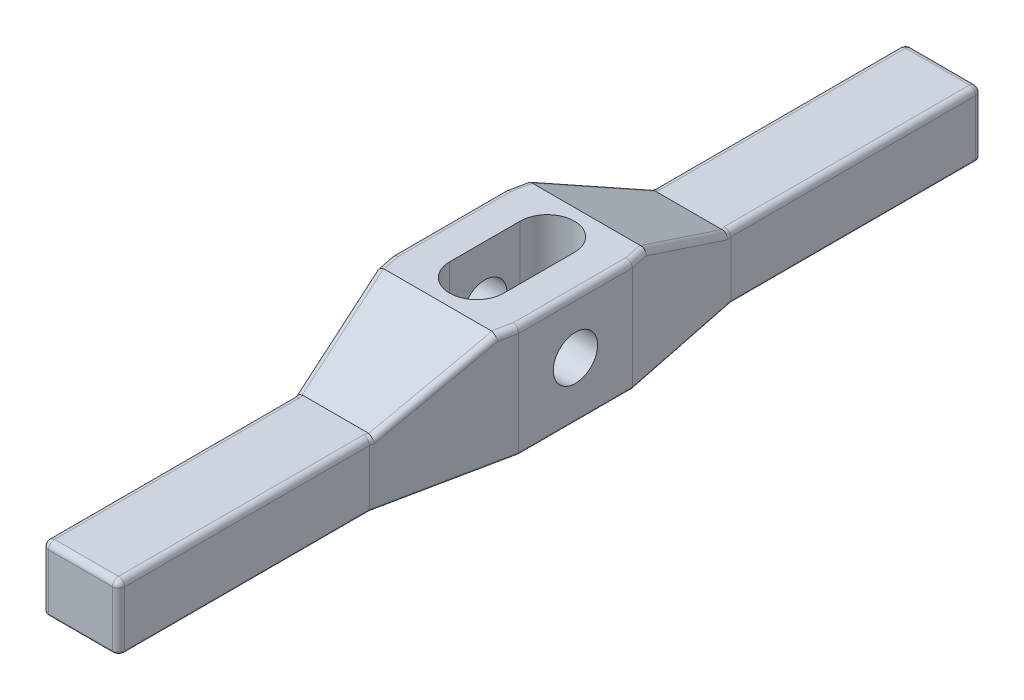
ISO-10303-21;
HEADER;
FILE_DESCRIPTION(('STEP AP214'),'2;1');
FILE_NAME('part.step','',(''),(''),'','','');
FILE_SCHEMA(('AUTOMOTIVE_DESIGN { 1 0 10303 214 1 1 1 1 }'));
ENDSEC;
DATA;
#1=APPLICATION_CONTEXT('core data for automotive mechanical design processes');
#2=APPLICATION_PROTOCOL_DEFINITION('international standard','automotive_design',2000,#1);
#3=PRODUCT_CONTEXT('',#1,'mechanical');
#4=PRODUCT('Part','Part','',(#3));
#5=PRODUCT_RELATED_PRODUCT_CATEGORY('part','',(#4));
#6=PRODUCT_DEFINITION_FORMATION('','',#4);
#7=PRODUCT_DEFINITION_CONTEXT('part definition',#1,'design');
#8=PRODUCT_DEFINITION('design','',#6,#7);
#9=PRODUCT_DEFINITION_SHAPE('','',#8);
#10=(LENGTH_UNIT() NAMED_UNIT(*) SI_UNIT(.MILLI.,.METRE.));
#11=(NAMED_UNIT(*) PLANE_ANGLE_UNIT() SI_UNIT($,.RADIAN.));
#12=(NAMED_UNIT(*) SI_UNIT($,.STERADIAN.) SOLID_ANGLE_UNIT());
#13=UNCERTAINTY_MEASURE_WITH_UNIT(LENGTH_MEASURE(1.E-05),#10,'distance_accuracy_value','');
#14=(GEOMETRIC_REPRESENTATION_CONTEXT(3) GLOBAL_UNCERTAINTY_ASSIGNED_CONTEXT((#13)) GLOBAL_UNIT_ASSIGNED_CONTEXT((#10,
#11,#12)) REPRESENTATION_CONTEXT('',''));
#15=CARTESIAN_POINT('',(0.,0.,0.));
#16=DIRECTION('',(0.,0.,1.));
#17=DIRECTION('',(1.,0.,0.));
#18=AXIS2_PLACEMENT_3D('',#15,#16,#17);
#19=CARTESIAN_POINT('',(9.52500000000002,27.813,107.95));
#20=DIRECTION('',(0.,1.,0.));
#21=DIRECTION('',(0.,0.,1.));
#22=AXIS2_PLACEMENT_3D('',#19,#20,#21);
#23=PLANE('',#22);
#24=DIRECTION('',(1.,0.,0.));
#25=VECTOR('',#24,1.);
#26=CARTESIAN_POINT('',(-15.875,27.813,-18.5674));
#27=LINE('',#26,#25);
#28=CARTESIAN_POINT('',(-13.4293790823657,27.813,-18.5674));
#29=VERTEX_POINT('',#28);
#30=CARTESIAN_POINT('',(13.4293790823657,27.813,-18.5674));
#31=VERTEX_POINT('',#30);
#32=EDGE_CURVE('E895',#29,#31,#27,.T.);
#33=ORIENTED_EDGE('',*,*,#32,.F.);
#34=DIRECTION('',(-0.200749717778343,0.,0.979642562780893));
#35=VECTOR('',#34,1.);
#36=CARTESIAN_POINT('',(-14.3820247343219,27.813,-13.9185654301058));
#37=LINE('',#36,#35);
#38=CARTESIAN_POINT('',(-14.351,27.813,-14.069963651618));
#39=VERTEX_POINT('',#38);
#40=EDGE_CURVE('E597',#29,#39,#37,.T.);
#41=ORIENTED_EDGE('',*,*,#40,.T.);
#42=DIRECTION('',(0.,0.,1.));
#43=VECTOR('',#42,1.);
#44=CARTESIAN_POINT('',(-14.351,27.813,14.224508));
#45=LINE('',#44,#43);
#46=CARTESIAN_POINT('',(-14.351,27.813,14.069963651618));
#47=VERTEX_POINT('',#46);
#48=EDGE_CURVE('E593',#39,#47,#45,.T.);
#49=ORIENTED_EDGE('',*,*,#48,.T.);
#50=DIRECTION('',(0.200749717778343,0.,0.979642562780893));
#51=VECTOR('',#50,1.);
#52=CARTESIAN_POINT('',(-13.4920732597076,27.813,18.2614574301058));
#53=LINE('',#52,#51);
#54=CARTESIAN_POINT('',(-13.4293790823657,27.813,18.5674));
#55=VERTEX_POINT('',#54);
#56=EDGE_CURVE('E595',#47,#55,#53,.T.);
#57=ORIENTED_EDGE('',*,*,#56,.T.);
#58=DIRECTION('',(1.,0.,0.));
#59=VECTOR('',#58,1.);
#60=CARTESIAN_POINT('',(-15.875,27.813,18.5674));
#61=LINE('',#60,#59);
#62=CARTESIAN_POINT('',(13.4293790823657,27.813,18.5674));
#63=VERTEX_POINT('',#62);
#64=EDGE_CURVE('E898',#55,#63,#61,.T.);
#65=ORIENTED_EDGE('',*,*,#64,.T.);
#66=DIRECTION('',(0.200749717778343,0.,-0.979642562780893));
#67=VECTOR('',#66,1.);
#68=CARTESIAN_POINT('',(14.3820247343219,27.813,13.9185654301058));
#69=LINE('',#68,#67);
#70=CARTESIAN_POINT('',(14.351,27.813,14.069963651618));
#71=VERTEX_POINT('',#70);
#72=EDGE_CURVE('E591',#63,#71,#69,.T.);
#73=ORIENTED_EDGE('',*,*,#72,.T.);
#74=DIRECTION('',(0.,0.,-1.));
#75=VECTOR('',#74,1.);
#76=CARTESIAN_POINT('',(14.351,27.813,-14.224508));
#77=LINE('',#76,#75);
#78=CARTESIAN_POINT('',(14.351,27.813,-14.069963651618));
#79=VERTEX_POINT('',#78);
#80=EDGE_CURVE('E589',#71,#79,#77,.T.);
#81=ORIENTED_EDGE('',*,*,#80,.T.);
#82=DIRECTION('',(-0.200749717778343,0.,-0.979642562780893));
#83=VECTOR('',#82,1.);
#84=CARTESIAN_POINT('',(13.4920732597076,27.813,-18.2614574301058));
#85=LINE('',#84,#83);
#86=EDGE_CURVE('E587',#79,#31,#85,.T.);
#87=ORIENTED_EDGE('',*,*,#86,.T.);
#88=EDGE_LOOP('',(#33,#41,#49,#57,#65,#73,#81,#87));
#89=FACE_BOUND('',#88,.T.);
#90=DIRECTION('',(0.,0.,1.));
#91=VECTOR('',#90,1.);
#92=CARTESIAN_POINT('',(-6.7818,27.813,-8.8265));
#93=LINE('',#92,#91);
#94=CARTESIAN_POINT('',(-6.7818,27.813,-8.8265));
#95=VERTEX_POINT('',#94);
#96=CARTESIAN_POINT('',(-6.7818,27.813,8.8265));
#97=VERTEX_POINT('',#96);
#98=EDGE_CURVE('E340',#95,#97,#93,.T.);
#99=ORIENTED_EDGE('',*,*,#98,.F.);
#100=CARTESIAN_POINT('',(0.,27.813,-8.8265));
#101=DIRECTION('',(0.,1.,0.));
#102=DIRECTION('',(0.,0.,1.));
#103=AXIS2_PLACEMENT_3D('',#100,#101,#102);
#104=CIRCLE('',#103,6.7818);
#105=CARTESIAN_POINT('',(6.7818,27.813,-8.8265));
#106=VERTEX_POINT('',#105);
#107=EDGE_CURVE('E330',#106,#95,#104,.T.);
#108=ORIENTED_EDGE('',*,*,#107,.F.);
#109=DIRECTION('',(0.,0.,-1.));
#110=VECTOR('',#109,1.);
#111=CARTESIAN_POINT('',(6.7818,27.813,-8.8265));
#112=LINE('',#111,#110);
#113=CARTESIAN_POINT('',(6.7818,27.813,8.8265));
#114=VERTEX_POINT('',#113);
#115=EDGE_CURVE('E355',#114,#106,#112,.T.);
#116=ORIENTED_EDGE('',*,*,#115,.F.);
#117=CARTESIAN_POINT('',(0.,27.813,8.8265));
#118=DIRECTION('',(0.,1.,0.));
#119=DIRECTION('',(0.,0.,1.));
#120=AXIS2_PLACEMENT_3D('',#117,#118,#119);
#121=CIRCLE('',#120,6.7818);
#122=EDGE_CURVE('E353',#97,#114,#121,.T.);
#123=ORIENTED_EDGE('',*,*,#122,.F.);
#124=EDGE_LOOP('',(#99,#108,#116,#123));
#125=FACE_BOUND('',#124,.T.);
#126=ADVANCED_FACE('F34',(#89,#125),#23,.T.);
#127=CARTESIAN_POINT('',(9.52500000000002,0.,107.95));
#128=DIRECTION('',(0.,1.,0.));
#129=DIRECTION('',(0.,0.,1.));
#130=AXIS2_PLACEMENT_3D('',#127,#128,#129);
#131=PLANE('',#130);
#132=DIRECTION('',(0.,0.,1.));
#133=VECTOR('',#132,1.);
#134=CARTESIAN_POINT('',(-15.367,0.,107.95));
#135=LINE('',#134,#133);
#136=CARTESIAN_POINT('',(-15.367,0.,14.172993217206));
#137=VERTEX_POINT('',#136);
#138=CARTESIAN_POINT('',(-15.367,0.,-14.172993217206));
#139=VERTEX_POINT('',#138);
#140=EDGE_CURVE('E445',#137,#139,#135,.F.);
#141=ORIENTED_EDGE('',*,*,#140,.T.);
#142=DIRECTION('',(-0.200749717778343,0.,0.979642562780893));
#143=VECTOR('',#142,1.);
#144=CARTESIAN_POINT('',(-38.3809115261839,0.,98.1330539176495));
#145=LINE('',#144,#143);
#146=CARTESIAN_POINT('',(-9.017,0.,-45.160485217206));
#147=VERTEX_POINT('',#146);
#148=EDGE_CURVE('E447',#139,#147,#145,.F.);
#149=ORIENTED_EDGE('',*,*,#148,.T.);
#150=DIRECTION('',(0.,0.,1.));
#151=VECTOR('',#150,1.);
#152=CARTESIAN_POINT('',(-9.01700000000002,0.,107.95));
#153=LINE('',#152,#151);
#154=CARTESIAN_POINT('',(-9.017,0.,-106.426));
#155=VERTEX_POINT('',#154);
#156=EDGE_CURVE('E432',#147,#155,#153,.F.);
#157=ORIENTED_EDGE('',*,*,#156,.T.);
#158=CARTESIAN_POINT('',(-8.001,0.,-106.426));
#159=DIRECTION('',(0.,1.,0.));
#160=DIRECTION('',(0.,0.,1.));
#161=AXIS2_PLACEMENT_3D('',#158,#159,#160);
#162=CIRCLE('',#161,1.016);
#163=CARTESIAN_POINT('',(-8.001,0.,-107.442));
#164=VERTEX_POINT('',#163);
#165=EDGE_CURVE('E430',#155,#164,#162,.F.);
#166=ORIENTED_EDGE('',*,*,#165,.T.);
#167=DIRECTION('',(-1.,0.,0.));
#168=VECTOR('',#167,1.);
#169=CARTESIAN_POINT('',(9.52500000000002,0.,-107.442));
#170=LINE('',#169,#168);
#171=CARTESIAN_POINT('',(8.00099999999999,0.,-107.442));
#172=VERTEX_POINT('',#171);
#173=EDGE_CURVE('E428',#164,#172,#170,.F.);
#174=ORIENTED_EDGE('',*,*,#173,.T.);
#175=CARTESIAN_POINT('',(8.00099999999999,0.,-106.426));
#176=DIRECTION('',(0.,1.,0.));
#177=DIRECTION('',(0.,0.,1.));
#178=AXIS2_PLACEMENT_3D('',#175,#176,#177);
#179=CIRCLE('',#178,1.016);
#180=CARTESIAN_POINT('',(9.017,0.,-106.426));
#181=VERTEX_POINT('',#180);
#182=EDGE_CURVE('E426',#172,#181,#179,.F.);
#183=ORIENTED_EDGE('',*,*,#182,.T.);
#184=DIRECTION('',(0.,0.,-1.));
#185=VECTOR('',#184,1.);
#186=CARTESIAN_POINT('',(9.01700000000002,0.,107.95));
#187=LINE('',#186,#185);
#188=CARTESIAN_POINT('',(9.017,0.,-45.160485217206));
#189=VERTEX_POINT('',#188);
#190=EDGE_CURVE('E416',#181,#189,#187,.F.);
#191=ORIENTED_EDGE('',*,*,#190,.T.);
#192=DIRECTION('',(-0.200749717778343,0.,-0.979642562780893));
#193=VECTOR('',#192,1.);
#194=CARTESIAN_POINT('',(39.1486350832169,0.,101.879483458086));
#195=LINE('',#194,#193);
#196=CARTESIAN_POINT('',(15.367,0.,-14.172993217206));
#197=VERTEX_POINT('',#196);
#198=EDGE_CURVE('E418',#189,#197,#195,.F.);
#199=ORIENTED_EDGE('',*,*,#198,.T.);
#200=DIRECTION('',(0.,0.,-1.));
#201=VECTOR('',#200,1.);
#202=CARTESIAN_POINT('',(15.367,0.,107.95));
#203=LINE('',#202,#201);
#204=CARTESIAN_POINT('',(15.367,0.,14.172993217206));
#205=VERTEX_POINT('',#204);
#206=EDGE_CURVE('E420',#197,#205,#203,.F.);
#207=ORIENTED_EDGE('',*,*,#206,.T.);
#208=DIRECTION('',(0.200749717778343,0.,-0.979642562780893));
#209=VECTOR('',#208,1.);
#210=CARTESIAN_POINT('',(-3.31089970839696,0.,105.319649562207));
#211=LINE('',#210,#209);
#212=CARTESIAN_POINT('',(9.017,0.,45.160485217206));
#213=VERTEX_POINT('',#212);
#214=EDGE_CURVE('E422',#205,#213,#211,.F.);
#215=ORIENTED_EDGE('',*,*,#214,.T.);
#216=DIRECTION('',(0.,0.,-1.));
#217=VECTOR('',#216,1.);
#218=CARTESIAN_POINT('',(9.017,0.,107.95));
#219=LINE('',#218,#217);
#220=CARTESIAN_POINT('',(9.017,0.,106.426));
#221=VERTEX_POINT('',#220);
#222=EDGE_CURVE('E424',#213,#221,#219,.F.);
#223=ORIENTED_EDGE('',*,*,#222,.T.);
#224=CARTESIAN_POINT('',(8.001,0.,106.426));
#225=DIRECTION('',(0.,1.,0.));
#226=DIRECTION('',(0.,0.,1.));
#227=AXIS2_PLACEMENT_3D('',#224,#225,#226);
#228=CIRCLE('',#227,1.016);
#229=CARTESIAN_POINT('',(8.001,0.,107.442));
#230=VERTEX_POINT('',#229);
#231=EDGE_CURVE('E434',#221,#230,#228,.F.);
#232=ORIENTED_EDGE('',*,*,#231,.T.);
#233=DIRECTION('',(1.,0.,0.));
#234=VECTOR('',#233,1.);
#235=CARTESIAN_POINT('',(9.52500000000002,0.,107.442));
#236=LINE('',#235,#234);
#237=CARTESIAN_POINT('',(-8.001,0.,107.442));
#238=VERTEX_POINT('',#237);
#239=EDGE_CURVE('E436',#230,#238,#236,.F.);
#240=ORIENTED_EDGE('',*,*,#239,.T.);
#241=CARTESIAN_POINT('',(-8.001,0.,106.426));
#242=DIRECTION('',(0.,1.,0.));
#243=DIRECTION('',(0.,0.,1.));
#244=AXIS2_PLACEMENT_3D('',#241,#242,#243);
#245=CIRCLE('',#244,1.016);
#246=CARTESIAN_POINT('',(-9.017,0.,106.426));
#247=VERTEX_POINT('',#246);
#248=EDGE_CURVE('E438',#238,#247,#245,.F.);
#249=ORIENTED_EDGE('',*,*,#248,.T.);
#250=DIRECTION('',(0.,0.,1.));
#251=VECTOR('',#250,1.);
#252=CARTESIAN_POINT('',(-9.017,0.,107.95));
#253=LINE('',#252,#251);
#254=CARTESIAN_POINT('',(-9.017,0.,45.160485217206));
#255=VERTEX_POINT('',#254);
#256=EDGE_CURVE('E440',#247,#255,#253,.F.);
#257=ORIENTED_EDGE('',*,*,#256,.T.);
#258=DIRECTION('',(0.200749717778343,0.,0.979642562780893));
#259=VECTOR('',#258,1.);
#260=CARTESIAN_POINT('',(4.07862326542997,0.,109.066079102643));
#261=LINE('',#260,#259);
#262=EDGE_CURVE('E443',#255,#137,#261,.F.);
#263=ORIENTED_EDGE('',*,*,#262,.T.);
#264=EDGE_LOOP('',(#141,#149,#157,#166,#174,#183,#191,#199,#207,#215,#223,#232,#240,#249,#257,#263));
#265=FACE_BOUND('',#264,.T.);
#266=CARTESIAN_POINT('',(0.,0.,-8.8265));
#267=DIRECTION('',(0.,1.,0.));
#268=DIRECTION('',(0.,0.,1.));
#269=AXIS2_PLACEMENT_3D('',#266,#267,#268);
#270=CIRCLE('',#269,6.7818);
#271=CARTESIAN_POINT('',(6.7818,0.,-8.8265));
#272=VERTEX_POINT('',#271);
#273=CARTESIAN_POINT('',(-6.7818,0.,-8.8265));
#274=VERTEX_POINT('',#273);
#275=EDGE_CURVE('E360',#272,#274,#270,.T.);
#276=ORIENTED_EDGE('',*,*,#275,.T.);
#277=DIRECTION('',(0.,0.,1.));
#278=VECTOR('',#277,1.);
#279=CARTESIAN_POINT('',(-6.7818,0.,-8.8265));
#280=LINE('',#279,#278);
#281=CARTESIAN_POINT('',(-6.7818,0.,8.8265));
#282=VERTEX_POINT('',#281);
#283=EDGE_CURVE('E347',#274,#282,#280,.T.);
#284=ORIENTED_EDGE('',*,*,#283,.T.);
#285=CARTESIAN_POINT('',(0.,0.,8.8265));
#286=DIRECTION('',(0.,1.,0.));
#287=DIRECTION('',(0.,0.,1.));
#288=AXIS2_PLACEMENT_3D('',#285,#286,#287);
#289=CIRCLE('',#288,6.7818);
#290=CARTESIAN_POINT('',(6.7818,0.,8.8265));
#291=VERTEX_POINT('',#290);
#292=EDGE_CURVE('E364',#282,#291,#289,.T.);
#293=ORIENTED_EDGE('',*,*,#292,.T.);
#294=DIRECTION('',(0.,0.,-1.));
#295=VECTOR('',#294,1.);
#296=CARTESIAN_POINT('',(6.7818,0.,-8.8265));
#297=LINE('',#296,#295);
#298=EDGE_CURVE('E341',#291,#272,#297,.T.);
#299=ORIENTED_EDGE('',*,*,#298,.T.);
#300=EDGE_LOOP('',(#276,#284,#293,#299));
#301=FACE_BOUND('',#300,.T.);
#302=ADVANCED_FACE('F738',(#265,#301),#131,.F.);
#303=CARTESIAN_POINT('',(9.525,27.813,-107.95));
#304=DIRECTION('',(-1.,0.,0.));
#305=DIRECTION('',(0.,0.,1.));
#306=AXIS2_PLACEMENT_3D('',#303,#304,#305);
#307=PLANE('',#306);
#308=DIRECTION('',(0.,-1.,0.));
#309=VECTOR('',#308,1.);
#310=CARTESIAN_POINT('',(9.525,27.813,-106.426));
#311=LINE('',#310,#309);
#312=CARTESIAN_POINT('',(9.525,0.508000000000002,-106.426));
#313=VERTEX_POINT('',#312);
#314=CARTESIAN_POINT('',(9.525,14.351,-106.426));
#315=VERTEX_POINT('',#314);
#316=EDGE_CURVE('E400',#313,#315,#311,.F.);
#317=ORIENTED_EDGE('',*,*,#316,.T.);
#318=DIRECTION('',(0.,0.,1.));
#319=VECTOR('',#318,1.);
#320=CARTESIAN_POINT('',(9.525,14.351,-107.95));
#321=LINE('',#320,#319);
#322=CARTESIAN_POINT('',(9.525,14.351,-45.212));
#323=VERTEX_POINT('',#322);
#324=EDGE_CURVE('E632',#315,#323,#321,.T.);
#325=ORIENTED_EDGE('',*,*,#324,.T.);
#326=DIRECTION('',(0.,-1.,0.));
#327=VECTOR('',#326,1.);
#328=CARTESIAN_POINT('',(9.525,27.813,-45.212));
#329=LINE('',#328,#327);
#330=CARTESIAN_POINT('',(9.525,0.508000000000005,-45.212));
#331=VERTEX_POINT('',#330);
#332=EDGE_CURVE('E348',#323,#331,#329,.T.);
#333=ORIENTED_EDGE('',*,*,#332,.T.);
#334=DIRECTION('',(0.,0.,-1.));
#335=VECTOR('',#334,1.);
#336=CARTESIAN_POINT('',(9.525,0.508000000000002,-107.95));
#337=LINE('',#336,#335);
#338=EDGE_CURVE('E489',#331,#313,#337,.T.);
#339=ORIENTED_EDGE('',*,*,#338,.T.);
#340=EDGE_LOOP('',(#317,#325,#333,#339));
#341=FACE_BOUND('',#340,.T.);
#342=ADVANCED_FACE('F723',(#341),#307,.F.);
#343=CARTESIAN_POINT('',(-9.525,27.813,-107.95));
#344=DIRECTION('',(0.,0.,1.));
#345=DIRECTION('',(1.,0.,0.));
#346=AXIS2_PLACEMENT_3D('',#343,#344,#345);
#347=PLANE('',#346);
#348=DIRECTION('',(0.,-1.,0.));
#349=VECTOR('',#348,1.);
#350=CARTESIAN_POINT('',(-8.001,27.813,-107.95));
#351=LINE('',#350,#349);
#352=CARTESIAN_POINT('',(-8.001,0.508000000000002,-107.95));
#353=VERTEX_POINT('',#352);
#354=CARTESIAN_POINT('',(-8.001,14.351,-107.95));
#355=VERTEX_POINT('',#354);
#356=EDGE_CURVE('E397',#353,#355,#351,.F.);
#357=ORIENTED_EDGE('',*,*,#356,.T.);
#358=DIRECTION('',(1.,0.,0.));
#359=VECTOR('',#358,1.);
#360=CARTESIAN_POINT('',(-9.525,14.351,-107.95));
#361=LINE('',#360,#359);
#362=CARTESIAN_POINT('',(8.00099999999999,14.351,-107.95));
#363=VERTEX_POINT('',#362);
#364=EDGE_CURVE('E570',#355,#363,#361,.T.);
#365=ORIENTED_EDGE('',*,*,#364,.T.);
#366=DIRECTION('',(0.,-1.,0.));
#367=VECTOR('',#366,1.);
#368=CARTESIAN_POINT('',(8.00099999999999,27.813,-107.95));
#369=LINE('',#368,#367);
#370=CARTESIAN_POINT('',(8.00099999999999,0.508000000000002,-107.95));
#371=VERTEX_POINT('',#370);
#372=EDGE_CURVE('E395',#363,#371,#369,.T.);
#373=ORIENTED_EDGE('',*,*,#372,.T.);
#374=DIRECTION('',(-1.,0.,0.));
#375=VECTOR('',#374,1.);
#376=CARTESIAN_POINT('',(-9.525,0.508000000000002,-107.95));
#377=LINE('',#376,#375);
#378=EDGE_CURVE('E463',#371,#353,#377,.T.);
#379=ORIENTED_EDGE('',*,*,#378,.T.);
#380=EDGE_LOOP('',(#357,#365,#373,#379));
#381=FACE_BOUND('',#380,.T.);
#382=ADVANCED_FACE('F753',(#381),#347,.F.);
#383=CARTESIAN_POINT('',(-9.525,27.813,-107.95));
#384=DIRECTION('',(1.,0.,0.));
#385=DIRECTION('',(0.,0.,-1.));
#386=AXIS2_PLACEMENT_3D('',#383,#384,#385);
#387=PLANE('',#386);
#388=DIRECTION('',(0.,-1.,0.));
#389=VECTOR('',#388,1.);
#390=CARTESIAN_POINT('',(-9.525,27.813,-45.212));
#391=LINE('',#390,#389);
#392=CARTESIAN_POINT('',(-9.525,14.351,-45.212));
#393=VERTEX_POINT('',#392);
#394=CARTESIAN_POINT('',(-9.525,0.508000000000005,-45.212));
#395=VERTEX_POINT('',#394);
#396=EDGE_CURVE('E386',#393,#395,#391,.T.);
#397=ORIENTED_EDGE('',*,*,#396,.F.);
#398=DIRECTION('',(0.,0.,-1.));
#399=VECTOR('',#398,1.);
#400=CARTESIAN_POINT('',(-9.525,14.351,-107.95));
#401=LINE('',#400,#399);
#402=CARTESIAN_POINT('',(-9.525,14.351,-106.426));
#403=VERTEX_POINT('',#402);
#404=EDGE_CURVE('E556',#393,#403,#401,.T.);
#405=ORIENTED_EDGE('',*,*,#404,.T.);
#406=DIRECTION('',(0.,-1.,0.));
#407=VECTOR('',#406,1.);
#408=CARTESIAN_POINT('',(-9.525,27.813,-106.426));
#409=LINE('',#408,#407);
#410=CARTESIAN_POINT('',(-9.525,0.508000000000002,-106.426));
#411=VERTEX_POINT('',#410);
#412=EDGE_CURVE('E388',#403,#411,#409,.T.);
#413=ORIENTED_EDGE('',*,*,#412,.T.);
#414=DIRECTION('',(0.,0.,1.));
#415=VECTOR('',#414,1.);
#416=CARTESIAN_POINT('',(-9.525,0.508000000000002,-107.95));
#417=LINE('',#416,#415);
#418=EDGE_CURVE('E457',#411,#395,#417,.T.);
#419=ORIENTED_EDGE('',*,*,#418,.T.);
#420=EDGE_LOOP('',(#397,#405,#413,#419));
#421=FACE_BOUND('',#420,.T.);
#422=ADVANCED_FACE('F962',(#421),#387,.F.);
#423=CARTESIAN_POINT('',(-9.525,27.813,-45.212));
#424=DIRECTION('',(0.979642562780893,0.,0.200749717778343));
#425=DIRECTION('',(0.200749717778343,0.,-0.979642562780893));
#426=AXIS2_PLACEMENT_3D('',#423,#424,#425);
#427=PLANE('',#426);
#428=DIRECTION('',(0.182599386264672,-0.41551295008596,-0.8910703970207));
#429=VECTOR('',#428,1.);
#430=CARTESIAN_POINT('',(-10.584441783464,16.26034085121,-40.0420088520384));
#431=LINE('',#430,#429);
#432=CARTESIAN_POINT('',(-14.9915896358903,26.289,-18.5354799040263));
#433=VERTEX_POINT('',#432);
#434=CARTESIAN_POINT('',(-9.74537174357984,14.351,-44.1366035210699));
#435=VERTEX_POINT('',#434);
#436=EDGE_CURVE('E576',#433,#435,#431,.T.);
#437=ORIENTED_EDGE('',*,*,#436,.T.);
#438=DIRECTION('',(0.200749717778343,0.,-0.979642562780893));
#439=VECTOR('',#438,1.);
#440=CARTESIAN_POINT('',(-9.525,14.351,-45.212));
#441=LINE('',#440,#439);
#442=EDGE_CURVE('E578',#435,#393,#441,.T.);
#443=ORIENTED_EDGE('',*,*,#442,.T.);
#444=ORIENTED_EDGE('',*,*,#396,.T.);
#445=DIRECTION('',(-0.200749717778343,0.,0.979642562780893));
#446=VECTOR('',#445,1.);
#447=CARTESIAN_POINT('',(-9.525,0.508000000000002,-45.212));
#448=LINE('',#447,#446);
#449=CARTESIAN_POINT('',(-15.875,0.508000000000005,-14.224508));
#450=VERTEX_POINT('',#449);
#451=EDGE_CURVE('E468',#395,#450,#448,.T.);
#452=ORIENTED_EDGE('',*,*,#451,.T.);
#453=DIRECTION('',(0.,-1.,0.));
#454=VECTOR('',#453,1.);
#455=CARTESIAN_POINT('',(-15.875,27.813,-14.224508));
#456=LINE('',#455,#454);
#457=CARTESIAN_POINT('',(-15.875,26.289,-14.224508));
#458=VERTEX_POINT('',#457);
#459=EDGE_CURVE('E384',#458,#450,#456,.T.);
#460=ORIENTED_EDGE('',*,*,#459,.F.);
#461=DIRECTION('',(-0.200749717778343,0.,0.979642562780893));
#462=VECTOR('',#461,1.);
#463=CARTESIAN_POINT('',(-14.9850485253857,26.289,-18.5674));
#464=LINE('',#463,#462);
#465=EDGE_CURVE('E574',#458,#433,#464,.F.);
#466=ORIENTED_EDGE('',*,*,#465,.T.);
#467=EDGE_LOOP('',(#437,#443,#444,#452,#460,#466));
#468=FACE_BOUND('',#467,.T.);
#469=ADVANCED_FACE('F877',(#468),#427,.F.);
#470=CARTESIAN_POINT('',(-15.875,27.813,-14.224508));
#471=DIRECTION('',(1.,0.,0.));
#472=DIRECTION('',(0.,0.,-1.));
#473=AXIS2_PLACEMENT_3D('',#470,#471,#472);
#474=PLANE('',#473);
#475=CARTESIAN_POINT('',(-15.875,13.9446,0.));
#476=DIRECTION('',(1.,0.,0.));
#477=DIRECTION('',(0.,0.,-1.));
#478=AXIS2_PLACEMENT_3D('',#475,#476,#477);
#479=CIRCLE('',#478,5.54355);
#480=CARTESIAN_POINT('',(-15.875,13.9446,-5.54355));
#481=VERTEX_POINT('',#480);
#482=EDGE_CURVE('E393',#481,#481,#479,.T.);
#483=ORIENTED_EDGE('',*,*,#482,.T.);
#484=EDGE_LOOP('',(#483));
#485=FACE_BOUND('',#484,.T.);
#486=DIRECTION('',(0.,-1.,0.));
#487=VECTOR('',#486,1.);
#488=CARTESIAN_POINT('',(-15.875,27.813,14.224508));
#489=LINE('',#488,#487);
#490=CARTESIAN_POINT('',(-15.875,26.289,14.224508));
#491=VERTEX_POINT('',#490);
#492=CARTESIAN_POINT('',(-15.875,0.508000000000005,14.224508));
#493=VERTEX_POINT('',#492);
#494=EDGE_CURVE('E382',#491,#493,#489,.T.);
#495=ORIENTED_EDGE('',*,*,#494,.F.);
#496=DIRECTION('',(0.,0.,1.));
#497=VECTOR('',#496,1.);
#498=CARTESIAN_POINT('',(-15.875,26.289,-14.224508));
#499=LINE('',#498,#497);
#500=EDGE_CURVE('E612',#491,#458,#499,.F.);
#501=ORIENTED_EDGE('',*,*,#500,.T.);
#502=ORIENTED_EDGE('',*,*,#459,.T.);
#503=DIRECTION('',(0.,0.,1.));
#504=VECTOR('',#503,1.);
#505=CARTESIAN_POINT('',(-15.875,0.508000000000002,-14.224508));
#506=LINE('',#505,#504);
#507=EDGE_CURVE('E471',#450,#493,#506,.T.);
#508=ORIENTED_EDGE('',*,*,#507,.T.);
#509=EDGE_LOOP('',(#495,#501,#502,#508));
#510=FACE_BOUND('',#509,.T.);
#511=ADVANCED_FACE('F874',(#485,#510),#474,.F.);
#512=CARTESIAN_POINT('',(-9.525,27.813,45.212));
#513=DIRECTION('',(0.979642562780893,0.,-0.200749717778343));
#514=DIRECTION('',(-0.200749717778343,0.,-0.979642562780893));
#515=AXIS2_PLACEMENT_3D('',#512,#513,#514);
#516=PLANE('',#515);
#517=DIRECTION('',(-0.182599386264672,0.41551295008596,-0.8910703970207));
#518=VECTOR('',#517,1.);
#519=CARTESIAN_POINT('',(-10.584441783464,16.26034085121,40.0420088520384));
#520=LINE('',#519,#518);
#521=CARTESIAN_POINT('',(-9.74537174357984,14.351,44.1366035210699));
#522=VERTEX_POINT('',#521);
#523=CARTESIAN_POINT('',(-14.9915896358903,26.289,18.5354799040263));
#524=VERTEX_POINT('',#523);
#525=EDGE_CURVE('E608',#522,#524,#520,.T.);
#526=ORIENTED_EDGE('',*,*,#525,.T.);
#527=DIRECTION('',(0.200749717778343,0.,0.979642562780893));
#528=VECTOR('',#527,1.);
#529=CARTESIAN_POINT('',(-15.875,26.289,14.224508));
#530=LINE('',#529,#528);
#531=EDGE_CURVE('E610',#524,#491,#530,.F.);
#532=ORIENTED_EDGE('',*,*,#531,.T.);
#533=ORIENTED_EDGE('',*,*,#494,.T.);
#534=DIRECTION('',(0.200749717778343,0.,0.979642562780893));
#535=VECTOR('',#534,1.);
#536=CARTESIAN_POINT('',(-9.525,0.508000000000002,45.212));
#537=LINE('',#536,#535);
#538=CARTESIAN_POINT('',(-9.525,0.508000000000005,45.212));
#539=VERTEX_POINT('',#538);
#540=EDGE_CURVE('E474',#493,#539,#537,.T.);
#541=ORIENTED_EDGE('',*,*,#540,.T.);
#542=DIRECTION('',(0.,-1.,0.));
#543=VECTOR('',#542,1.);
#544=CARTESIAN_POINT('',(-9.525,27.813,45.212));
#545=LINE('',#544,#543);
#546=CARTESIAN_POINT('',(-9.525,14.351,45.212));
#547=VERTEX_POINT('',#546);
#548=EDGE_CURVE('E380',#547,#539,#545,.T.);
#549=ORIENTED_EDGE('',*,*,#548,.F.);
#550=DIRECTION('',(-0.200749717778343,0.,-0.979642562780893));
#551=VECTOR('',#550,1.);
#552=CARTESIAN_POINT('',(-9.525,14.351,45.212));
#553=LINE('',#552,#551);
#554=EDGE_CURVE('E606',#547,#522,#553,.T.);
#555=ORIENTED_EDGE('',*,*,#554,.T.);
#556=EDGE_LOOP('',(#526,#532,#533,#541,#549,#555));
#557=FACE_BOUND('',#556,.T.);
#558=ADVANCED_FACE('F848',(#557),#516,.F.);
#559=CARTESIAN_POINT('',(-9.525,27.813,107.95));
#560=DIRECTION('',(1.,0.,0.));
#561=DIRECTION('',(0.,0.,-1.));
#562=AXIS2_PLACEMENT_3D('',#559,#560,#561);
#563=PLANE('',#562);
#564=DIRECTION('',(0.,-1.,0.));
#565=VECTOR('',#564,1.);
#566=CARTESIAN_POINT('',(-9.525,27.813,106.426));
#567=LINE('',#566,#565);
#568=CARTESIAN_POINT('',(-9.525,0.508000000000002,106.426));
#569=VERTEX_POINT('',#568);
#570=CARTESIAN_POINT('',(-9.525,14.351,106.426));
#571=VERTEX_POINT('',#570);
#572=EDGE_CURVE('E410',#569,#571,#567,.F.);
#573=ORIENTED_EDGE('',*,*,#572,.T.);
#574=DIRECTION('',(0.,0.,-1.));
#575=VECTOR('',#574,1.);
#576=CARTESIAN_POINT('',(-9.525,14.351,107.95));
#577=LINE('',#576,#575);
#578=EDGE_CURVE('E614',#571,#547,#577,.T.);
#579=ORIENTED_EDGE('',*,*,#578,.T.);
#580=ORIENTED_EDGE('',*,*,#548,.T.);
#581=DIRECTION('',(0.,0.,1.));
#582=VECTOR('',#581,1.);
#583=CARTESIAN_POINT('',(-9.525,0.508000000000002,107.95));
#584=LINE('',#583,#582);
#585=EDGE_CURVE('E413',#539,#569,#584,.T.);
#586=ORIENTED_EDGE('',*,*,#585,.T.);
#587=EDGE_LOOP('',(#573,#579,#580,#586));
#588=FACE_BOUND('',#587,.T.);
#589=ADVANCED_FACE('F827',(#588),#563,.F.);
#590=CARTESIAN_POINT('',(-9.525,27.813,107.95));
#591=DIRECTION('',(0.,0.,-1.));
#592=DIRECTION('',(-1.,0.,0.));
#593=AXIS2_PLACEMENT_3D('',#590,#591,#592);
#594=PLANE('',#593);
#595=DIRECTION('',(0.,-1.,0.));
#596=VECTOR('',#595,1.);
#597=CARTESIAN_POINT('',(8.001,27.813,107.95));
#598=LINE('',#597,#596);
#599=CARTESIAN_POINT('',(8.001,0.508000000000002,107.95));
#600=VERTEX_POINT('',#599);
#601=CARTESIAN_POINT('',(8.001,14.351,107.95));
#602=VERTEX_POINT('',#601);
#603=EDGE_CURVE('E407',#600,#602,#598,.F.);
#604=ORIENTED_EDGE('',*,*,#603,.T.);
#605=DIRECTION('',(1.,0.,0.));
#606=VECTOR('',#605,1.);
#607=CARTESIAN_POINT('',(-9.525,14.351,107.95));
#608=LINE('',#607,#606);
#609=CARTESIAN_POINT('',(-8.001,14.351,107.95));
#610=VERTEX_POINT('',#609);
#611=EDGE_CURVE('E552',#602,#610,#608,.F.);
#612=ORIENTED_EDGE('',*,*,#611,.T.);
#613=DIRECTION('',(0.,-1.,0.));
#614=VECTOR('',#613,1.);
#615=CARTESIAN_POINT('',(-8.001,27.813,107.95));
#616=LINE('',#615,#614);
#617=CARTESIAN_POINT('',(-8.001,0.508000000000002,107.95));
#618=VERTEX_POINT('',#617);
#619=EDGE_CURVE('E405',#610,#618,#616,.T.);
#620=ORIENTED_EDGE('',*,*,#619,.T.);
#621=DIRECTION('',(1.,0.,0.));
#622=VECTOR('',#621,1.);
#623=CARTESIAN_POINT('',(-9.525,0.508000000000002,107.95));
#624=LINE('',#623,#622);
#625=EDGE_CURVE('E452',#618,#600,#624,.T.);
#626=ORIENTED_EDGE('',*,*,#625,.T.);
#627=EDGE_LOOP('',(#604,#612,#620,#626));
#628=FACE_BOUND('',#627,.T.);
#629=ADVANCED_FACE('F949',(#628),#594,.F.);
#630=CARTESIAN_POINT('',(9.525,27.813,107.95));
#631=DIRECTION('',(-1.,0.,0.));
#632=DIRECTION('',(0.,0.,1.));
#633=AXIS2_PLACEMENT_3D('',#630,#631,#632);
#634=PLANE('',#633);
#635=DIRECTION('',(0.,-1.,0.));
#636=VECTOR('',#635,1.);
#637=CARTESIAN_POINT('',(9.525,27.813,45.212));
#638=LINE('',#637,#636);
#639=CARTESIAN_POINT('',(9.525,14.351,45.212));
#640=VERTEX_POINT('',#639);
#641=CARTESIAN_POINT('',(9.525,0.508000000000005,45.212));
#642=VERTEX_POINT('',#641);
#643=EDGE_CURVE('E378',#640,#642,#638,.T.);
#644=ORIENTED_EDGE('',*,*,#643,.F.);
#645=DIRECTION('',(0.,0.,1.));
#646=VECTOR('',#645,1.);
#647=CARTESIAN_POINT('',(9.525,14.351,107.95));
#648=LINE('',#647,#646);
#649=CARTESIAN_POINT('',(9.525,14.351,106.426));
#650=VERTEX_POINT('',#649);
#651=EDGE_CURVE('E616',#640,#650,#648,.T.);
#652=ORIENTED_EDGE('',*,*,#651,.T.);
#653=DIRECTION('',(0.,-1.,0.));
#654=VECTOR('',#653,1.);
#655=CARTESIAN_POINT('',(9.525,27.813,106.426));
#656=LINE('',#655,#654);
#657=CARTESIAN_POINT('',(9.525,0.508000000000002,106.426));
#658=VERTEX_POINT('',#657);
#659=EDGE_CURVE('E403',#650,#658,#656,.T.);
#660=ORIENTED_EDGE('',*,*,#659,.T.);
#661=DIRECTION('',(0.,0.,-1.));
#662=VECTOR('',#661,1.);
#663=CARTESIAN_POINT('',(9.525,0.508000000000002,107.95));
#664=LINE('',#663,#662);
#665=EDGE_CURVE('E477',#658,#642,#664,.T.);
#666=ORIENTED_EDGE('',*,*,#665,.T.);
#667=EDGE_LOOP('',(#644,#652,#660,#666));
#668=FACE_BOUND('',#667,.T.);
#669=ADVANCED_FACE('F945',(#668),#634,.F.);
#670=CARTESIAN_POINT('',(9.525,27.813,45.212));
#671=DIRECTION('',(-0.979642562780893,0.,-0.200749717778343));
#672=DIRECTION('',(-0.200749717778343,0.,0.979642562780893));
#673=AXIS2_PLACEMENT_3D('',#670,#671,#672);
#674=PLANE('',#673);
#675=DIRECTION('',(-0.182599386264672,-0.41551295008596,0.8910703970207));
#676=VECTOR('',#675,1.);
#677=CARTESIAN_POINT('',(10.584441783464,16.26034085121,40.0420088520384));
#678=LINE('',#677,#676);
#679=CARTESIAN_POINT('',(14.9915896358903,26.289,18.5354799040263));
#680=VERTEX_POINT('',#679);
#681=CARTESIAN_POINT('',(9.74537174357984,14.351,44.1366035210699));
#682=VERTEX_POINT('',#681);
#683=EDGE_CURVE('E620',#680,#682,#678,.T.);
#684=ORIENTED_EDGE('',*,*,#683,.T.);
#685=DIRECTION('',(-0.200749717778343,0.,0.979642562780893));
#686=VECTOR('',#685,1.);
#687=CARTESIAN_POINT('',(9.525,14.351,45.212));
#688=LINE('',#687,#686);
#689=EDGE_CURVE('E622',#682,#640,#688,.T.);
#690=ORIENTED_EDGE('',*,*,#689,.T.);
#691=ORIENTED_EDGE('',*,*,#643,.T.);
#692=DIRECTION('',(0.200749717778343,0.,-0.979642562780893));
#693=VECTOR('',#692,1.);
#694=CARTESIAN_POINT('',(9.525,0.508000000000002,45.212));
#695=LINE('',#694,#693);
#696=CARTESIAN_POINT('',(15.875,0.508000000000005,14.224508));
#697=VERTEX_POINT('',#696);
#698=EDGE_CURVE('E480',#642,#697,#695,.T.);
#699=ORIENTED_EDGE('',*,*,#698,.T.);
#700=DIRECTION('',(0.,-1.,0.));
#701=VECTOR('',#700,1.);
#702=CARTESIAN_POINT('',(15.875,27.813,14.224508));
#703=LINE('',#702,#701);
#704=CARTESIAN_POINT('',(15.875,26.289,14.224508));
#705=VERTEX_POINT('',#704);
#706=EDGE_CURVE('E376',#705,#697,#703,.T.);
#707=ORIENTED_EDGE('',*,*,#706,.F.);
#708=DIRECTION('',(0.200749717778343,0.,-0.979642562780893));
#709=VECTOR('',#708,1.);
#710=CARTESIAN_POINT('',(14.9850485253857,26.289,18.5674));
#711=LINE('',#710,#709);
#712=EDGE_CURVE('E618',#705,#680,#711,.F.);
#713=ORIENTED_EDGE('',*,*,#712,.T.);
#714=EDGE_LOOP('',(#684,#690,#691,#699,#707,#713));
#715=FACE_BOUND('',#714,.T.);
#716=ADVANCED_FACE('F941',(#715),#674,.F.);
#717=CARTESIAN_POINT('',(15.875,27.813,-14.224508));
#718=DIRECTION('',(-1.,0.,0.));
#719=DIRECTION('',(0.,0.,1.));
#720=AXIS2_PLACEMENT_3D('',#717,#718,#719);
#721=PLANE('',#720);
#722=CARTESIAN_POINT('',(15.875,13.9446,0.));
#723=DIRECTION('',(1.,0.,0.));
#724=DIRECTION('',(0.,0.,-1.));
#725=AXIS2_PLACEMENT_3D('',#722,#723,#724);
#726=CIRCLE('',#725,5.54355);
#727=CARTESIAN_POINT('',(15.875,13.9446,-5.54355));
#728=VERTEX_POINT('',#727);
#729=EDGE_CURVE('E538',#728,#728,#726,.T.);
#730=ORIENTED_EDGE('',*,*,#729,.F.);
#731=EDGE_LOOP('',(#730));
#732=FACE_BOUND('',#731,.T.);
#733=DIRECTION('',(0.,-1.,0.));
#734=VECTOR('',#733,1.);
#735=CARTESIAN_POINT('',(15.875,27.813,-14.224508));
#736=LINE('',#735,#734);
#737=CARTESIAN_POINT('',(15.875,26.289,-14.224508));
#738=VERTEX_POINT('',#737);
#739=CARTESIAN_POINT('',(15.875,0.508000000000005,-14.224508));
#740=VERTEX_POINT('',#739);
#741=EDGE_CURVE('E374',#738,#740,#736,.T.);
#742=ORIENTED_EDGE('',*,*,#741,.F.);
#743=DIRECTION('',(0.,0.,-1.));
#744=VECTOR('',#743,1.);
#745=CARTESIAN_POINT('',(15.875,26.289,14.224508));
#746=LINE('',#745,#744);
#747=EDGE_CURVE('E624',#738,#705,#746,.F.);
#748=ORIENTED_EDGE('',*,*,#747,.T.);
#749=ORIENTED_EDGE('',*,*,#706,.T.);
#750=DIRECTION('',(0.,0.,-1.));
#751=VECTOR('',#750,1.);
#752=CARTESIAN_POINT('',(15.875,0.508000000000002,-14.224508));
#753=LINE('',#752,#751);
#754=EDGE_CURVE('E483',#697,#740,#753,.T.);
#755=ORIENTED_EDGE('',*,*,#754,.T.);
#756=EDGE_LOOP('',(#742,#748,#749,#755));
#757=FACE_BOUND('',#756,.T.);
#758=ADVANCED_FACE('F788',(#732,#757),#721,.F.);
#759=CARTESIAN_POINT('',(9.525,27.813,-45.212));
#760=DIRECTION('',(-0.979642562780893,0.,0.200749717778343));
#761=DIRECTION('',(0.200749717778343,0.,0.979642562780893));
#762=AXIS2_PLACEMENT_3D('',#759,#760,#761);
#763=PLANE('',#762);
#764=DIRECTION('',(0.182599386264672,0.41551295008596,0.8910703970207));
#765=VECTOR('',#764,1.);
#766=CARTESIAN_POINT('',(10.584441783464,16.26034085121,-40.0420088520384));
#767=LINE('',#766,#765);
#768=CARTESIAN_POINT('',(9.74537174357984,14.351,-44.1366035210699));
#769=VERTEX_POINT('',#768);
#770=CARTESIAN_POINT('',(14.9915896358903,26.289,-18.5354799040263));
#771=VERTEX_POINT('',#770);
#772=EDGE_CURVE('E626',#769,#771,#767,.T.);
#773=ORIENTED_EDGE('',*,*,#772,.T.);
#774=DIRECTION('',(-0.200749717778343,0.,-0.979642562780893));
#775=VECTOR('',#774,1.);
#776=CARTESIAN_POINT('',(15.875,26.289,-14.224508));
#777=LINE('',#776,#775);
#778=EDGE_CURVE('E630',#771,#738,#777,.F.);
#779=ORIENTED_EDGE('',*,*,#778,.T.);
#780=ORIENTED_EDGE('',*,*,#741,.T.);
#781=DIRECTION('',(-0.200749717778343,0.,-0.979642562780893));
#782=VECTOR('',#781,1.);
#783=CARTESIAN_POINT('',(9.525,0.508000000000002,-45.212));
#784=LINE('',#783,#782);
#785=EDGE_CURVE('E486',#740,#331,#784,.T.);
#786=ORIENTED_EDGE('',*,*,#785,.T.);
#787=ORIENTED_EDGE('',*,*,#332,.F.);
#788=DIRECTION('',(0.200749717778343,0.,0.979642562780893));
#789=VECTOR('',#788,1.);
#790=CARTESIAN_POINT('',(9.525,14.351,-45.212));
#791=LINE('',#790,#789);
#792=EDGE_CURVE('E628',#323,#769,#791,.T.);
#793=ORIENTED_EDGE('',*,*,#792,.T.);
#794=EDGE_LOOP('',(#773,#779,#780,#786,#787,#793));
#795=FACE_BOUND('',#794,.T.);
#796=ADVANCED_FACE('F781',(#795),#763,.F.);
#797=CARTESIAN_POINT('',(0.,27.813,-8.8265));
#798=DIRECTION('',(0.,-1.,0.));
#799=DIRECTION('',(0.,0.,-1.));
#800=AXIS2_PLACEMENT_3D('',#797,#798,#799);
#801=CYLINDRICAL_SURFACE('',#800,6.7818);
#802=ORIENTED_EDGE('',*,*,#275,.F.);
#803=DIRECTION('',(0.,-1.,0.));
#804=VECTOR('',#803,1.);
#805=CARTESIAN_POINT('',(6.7818,27.813,-8.8265));
#806=LINE('',#805,#804);
#807=EDGE_CURVE('E336',#106,#272,#806,.T.);
#808=ORIENTED_EDGE('',*,*,#807,.F.);
#809=ORIENTED_EDGE('',*,*,#107,.T.);
#810=DIRECTION('',(0.,-1.,0.));
#811=VECTOR('',#810,1.);
#812=CARTESIAN_POINT('',(-6.7818,27.813,-8.8265));
#813=LINE('',#812,#811);
#814=EDGE_CURVE('E333',#95,#274,#813,.T.);
#815=ORIENTED_EDGE('',*,*,#814,.T.);
#816=EDGE_LOOP('',(#802,#808,#809,#815));
#817=FACE_BOUND('',#816,.T.);
#818=ADVANCED_FACE('F332',(#817),#801,.F.);
#819=CARTESIAN_POINT('',(-6.7818,27.813,-8.8265));
#820=DIRECTION('',(1.,0.,0.));
#821=DIRECTION('',(0.,0.,-1.));
#822=AXIS2_PLACEMENT_3D('',#819,#820,#821);
#823=PLANE('',#822);
#824=CARTESIAN_POINT('',(-6.7818,13.9446,0.));
#825=DIRECTION('',(1.,0.,0.));
#826=DIRECTION('',(0.,0.,-1.));
#827=AXIS2_PLACEMENT_3D('',#824,#825,#826);
#828=CIRCLE('',#827,5.54355);
#829=CARTESIAN_POINT('',(-6.7818,13.9446,-5.54355));
#830=VERTEX_POINT('',#829);
#831=EDGE_CURVE('E392',#830,#830,#828,.T.);
#832=ORIENTED_EDGE('',*,*,#831,.F.);
#833=EDGE_LOOP('',(#832));
#834=FACE_BOUND('',#833,.T.);
#835=ORIENTED_EDGE('',*,*,#283,.F.);
#836=ORIENTED_EDGE('',*,*,#814,.F.);
#837=ORIENTED_EDGE('',*,*,#98,.T.);
#838=DIRECTION('',(0.,-1.,0.));
#839=VECTOR('',#838,1.);
#840=CARTESIAN_POINT('',(-6.7818,27.813,8.8265));
#841=LINE('',#840,#839);
#842=EDGE_CURVE('E349',#97,#282,#841,.T.);
#843=ORIENTED_EDGE('',*,*,#842,.T.);
#844=EDGE_LOOP('',(#835,#836,#837,#843));
#845=FACE_BOUND('',#844,.T.);
#846=ADVANCED_FACE('F344',(#834,#845),#823,.T.);
#847=CARTESIAN_POINT('',(0.,27.813,8.8265));
#848=DIRECTION('',(0.,-1.,0.));
#849=DIRECTION('',(0.,0.,-1.));
#850=AXIS2_PLACEMENT_3D('',#847,#848,#849);
#851=CYLINDRICAL_SURFACE('',#850,6.7818);
#852=ORIENTED_EDGE('',*,*,#292,.F.);
#853=ORIENTED_EDGE('',*,*,#842,.F.);
#854=ORIENTED_EDGE('',*,*,#122,.T.);
#855=DIRECTION('',(0.,-1.,0.));
#856=VECTOR('',#855,1.);
#857=CARTESIAN_POINT('',(6.7818,27.813,8.8265));
#858=LINE('',#857,#856);
#859=EDGE_CURVE('E370',#114,#291,#858,.T.);
#860=ORIENTED_EDGE('',*,*,#859,.T.);
#861=EDGE_LOOP('',(#852,#853,#854,#860));
#862=FACE_BOUND('',#861,.T.);
#863=ADVANCED_FACE('F1301',(#862),#851,.F.);
#864=CARTESIAN_POINT('',(6.7818,27.813,-8.8265));
#865=DIRECTION('',(-1.,0.,0.));
#866=DIRECTION('',(0.,0.,1.));
#867=AXIS2_PLACEMENT_3D('',#864,#865,#866);
#868=PLANE('',#867);
#869=CARTESIAN_POINT('',(6.7818,13.9446,0.));
#870=DIRECTION('',(-1.,0.,0.));
#871=DIRECTION('',(0.,0.,1.));
#872=AXIS2_PLACEMENT_3D('',#869,#870,#871);
#873=CIRCLE('',#872,5.54355);
#874=CARTESIAN_POINT('',(6.7818,13.9446,5.54355));
#875=VERTEX_POINT('',#874);
#876=EDGE_CURVE('E389',#875,#875,#873,.T.);
#877=ORIENTED_EDGE('',*,*,#876,.F.);
#878=EDGE_LOOP('',(#877));
#879=FACE_BOUND('',#878,.T.);
#880=ORIENTED_EDGE('',*,*,#298,.F.);
#881=ORIENTED_EDGE('',*,*,#859,.F.);
#882=ORIENTED_EDGE('',*,*,#115,.T.);
#883=ORIENTED_EDGE('',*,*,#807,.T.);
#884=EDGE_LOOP('',(#880,#881,#882,#883));
#885=FACE_BOUND('',#884,.T.);
#886=ADVANCED_FACE('F1201',(#879,#885),#868,.T.);
#887=CARTESIAN_POINT('',(-15.875,15.875,-44.1685236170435));
#888=DIRECTION('',(0.,-1.,0.));
#889=DIRECTION('',(0.,0.,-1.));
#890=AXIS2_PLACEMENT_3D('',#887,#888,#889);
#891=PLANE('',#890);
#892=DIRECTION('',(0.,0.,-1.));
#893=VECTOR('',#892,1.);
#894=CARTESIAN_POINT('',(-8.001,15.875,-44.1685236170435));
#895=LINE('',#894,#893);
#896=CARTESIAN_POINT('',(-8.001,15.875,-106.426));
#897=VERTEX_POINT('',#896);
#898=CARTESIAN_POINT('',(-8.001,15.875,-45.057455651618));
#899=VERTEX_POINT('',#898);
#900=EDGE_CURVE('E564',#897,#899,#895,.F.);
#901=ORIENTED_EDGE('',*,*,#900,.T.);
#902=DIRECTION('',(0.200749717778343,0.,-0.979642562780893));
#903=VECTOR('',#902,1.);
#904=CARTESIAN_POINT('',(-8.49314574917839,15.875,-42.6558237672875));
#905=LINE('',#904,#903);
#906=CARTESIAN_POINT('',(-8.18316119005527,15.875,-44.1685236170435));
#907=VERTEX_POINT('',#906);
#908=EDGE_CURVE('E566',#899,#907,#905,.F.);
#909=ORIENTED_EDGE('',*,*,#908,.T.);
#910=DIRECTION('',(1.,0.,0.));
#911=VECTOR('',#910,1.);
#912=CARTESIAN_POINT('',(-15.875,15.875,-44.1685236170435));
#913=LINE('',#912,#911);
#914=CARTESIAN_POINT('',(8.18316119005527,15.875,-44.1685236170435));
#915=VERTEX_POINT('',#914);
#916=EDGE_CURVE('E362',#907,#915,#913,.T.);
#917=ORIENTED_EDGE('',*,*,#916,.T.);
#918=DIRECTION('',(0.200749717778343,0.,0.979642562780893));
#919=VECTOR('',#918,1.);
#920=CARTESIAN_POINT('',(7.2136064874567,15.875,-48.8998730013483));
#921=LINE('',#920,#919);
#922=CARTESIAN_POINT('',(8.001,15.875,-45.057455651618));
#923=VERTEX_POINT('',#922);
#924=EDGE_CURVE('E560',#915,#923,#921,.F.);
#925=ORIENTED_EDGE('',*,*,#924,.T.);
#926=DIRECTION('',(0.,0.,1.));
#927=VECTOR('',#926,1.);
#928=CARTESIAN_POINT('',(8.001,15.875,-44.1685236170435));
#929=LINE('',#928,#927);
#930=CARTESIAN_POINT('',(8.001,15.875,-106.426));
#931=VERTEX_POINT('',#930);
#932=EDGE_CURVE('E558',#923,#931,#929,.F.);
#933=ORIENTED_EDGE('',*,*,#932,.T.);
#934=DIRECTION('',(1.,0.,0.));
#935=VECTOR('',#934,1.);
#936=CARTESIAN_POINT('',(-15.875,15.875,-106.426));
#937=LINE('',#936,#935);
#938=EDGE_CURVE('E562',#931,#897,#937,.F.);
#939=ORIENTED_EDGE('',*,*,#938,.T.);
#940=EDGE_LOOP('',(#901,#909,#917,#925,#933,#939));
#941=FACE_BOUND('',#940,.T.);
#942=ADVANCED_FACE('F769',(#941),#891,.F.);
#943=CARTESIAN_POINT('',(-15.875,27.813,-18.5674));
#944=DIRECTION('',(0.,-0.906307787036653,0.422618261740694));
#945=DIRECTION('',(0.,-0.422618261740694,-0.906307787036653));
#946=AXIS2_PLACEMENT_3D('',#943,#944,#945);
#947=PLANE('',#946);
#948=CARTESIAN_POINT('',(-7.51343124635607,14.351,-47.4367521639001));
#949=DIRECTION('',(0.,-0.906307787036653,0.422618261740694));
#950=DIRECTION('',(0.220538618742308,-0.41221265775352,-0.883992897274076));
#951=AXIS2_PLACEMENT_3D('',#948,#949,#950);
#952=ELLIPSE('',#951,3.68102749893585,1.524);
#953=CARTESIAN_POINT('',(-8.31273027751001,15.8695052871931,-44.1803070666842));
#954=VERTEX_POINT('',#953);
#955=EDGE_CURVE('E634',#907,#954,#952,.T.);
#956=ORIENTED_EDGE('',*,*,#955,.T.);
#957=DIRECTION('',(0.182599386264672,-0.41551295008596,-0.8910703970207));
#958=VECTOR('',#957,1.);
#959=CARTESIAN_POINT('',(-13.6385053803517,27.9885412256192,-18.1909506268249));
#960=LINE('',#959,#958);
#961=CARTESIAN_POINT('',(-13.5589481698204,27.8075052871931,-18.5791834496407));
#962=VERTEX_POINT('',#961);
#963=EDGE_CURVE('E585',#954,#962,#960,.F.);
#964=ORIENTED_EDGE('',*,*,#963,.T.);
#965=CARTESIAN_POINT('',(-12.7596491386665,26.289,-21.8356285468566));
#966=DIRECTION('',(0.,-0.906307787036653,0.422618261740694));
#967=DIRECTION('',(0.220538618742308,-0.41221265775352,-0.883992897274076));
#968=AXIS2_PLACEMENT_3D('',#965,#966,#967);
#969=ELLIPSE('',#968,3.68102749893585,1.524);
#970=EDGE_CURVE('E583',#962,#29,#969,.F.);
#971=ORIENTED_EDGE('',*,*,#970,.T.);
#972=ORIENTED_EDGE('',*,*,#32,.T.);
#973=CARTESIAN_POINT('',(12.7596491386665,26.289,-21.8356285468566));
#974=DIRECTION('',(0.,-0.906307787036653,0.422618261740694));
#975=DIRECTION('',(0.220538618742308,0.41221265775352,0.883992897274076));
#976=AXIS2_PLACEMENT_3D('',#973,#974,#975);
#977=ELLIPSE('',#976,3.68102749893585,1.524);
#978=CARTESIAN_POINT('',(13.5589481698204,27.8075052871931,-18.5791834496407));
#979=VERTEX_POINT('',#978);
#980=EDGE_CURVE('E581',#31,#979,#977,.F.);
#981=ORIENTED_EDGE('',*,*,#980,.T.);
#982=DIRECTION('',(0.182599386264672,0.41551295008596,0.8910703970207));
#983=VECTOR('',#982,1.);
#984=CARTESIAN_POINT('',(12.5798798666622,25.5795922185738,-23.3569584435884));
#985=LINE('',#984,#983);
#986=CARTESIAN_POINT('',(8.31273027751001,15.8695052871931,-44.1803070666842));
#987=VERTEX_POINT('',#986);
#988=EDGE_CURVE('E50',#979,#987,#985,.F.);
#989=ORIENTED_EDGE('',*,*,#988,.T.);
#990=CARTESIAN_POINT('',(7.51343124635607,14.351,-47.4367521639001));
#991=DIRECTION('',(0.,-0.906307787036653,0.422618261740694));
#992=DIRECTION('',(0.220538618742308,0.41221265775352,0.883992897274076));
#993=AXIS2_PLACEMENT_3D('',#990,#991,#992);
#994=ELLIPSE('',#993,3.68102749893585,1.524);
#995=EDGE_CURVE('E11',#987,#915,#994,.T.);
#996=ORIENTED_EDGE('',*,*,#995,.T.);
#997=ORIENTED_EDGE('',*,*,#916,.F.);
#998=EDGE_LOOP('',(#956,#964,#971,#972,#981,#989,#996,#997));
#999=FACE_BOUND('',#998,.T.);
#1000=ADVANCED_FACE('F894',(#999),#947,.F.);
#1001=CARTESIAN_POINT('',(-15.875,15.875,44.1685236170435));
#1002=DIRECTION('',(0.,-1.,0.));
#1003=DIRECTION('',(0.,0.,-1.));
#1004=AXIS2_PLACEMENT_3D('',#1001,#1002,#1003);
#1005=PLANE('',#1004);
#1006=DIRECTION('',(1.,0.,0.));
#1007=VECTOR('',#1006,1.);
#1008=CARTESIAN_POINT('',(-15.875,15.875,44.1685236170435));
#1009=LINE('',#1008,#1007);
#1010=CARTESIAN_POINT('',(-8.18316119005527,15.875,44.1685236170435));
#1011=VERTEX_POINT('',#1010);
#1012=CARTESIAN_POINT('',(8.18316119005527,15.875,44.1685236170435));
#1013=VERTEX_POINT('',#1012);
#1014=EDGE_CURVE('E900',#1011,#1013,#1009,.T.);
#1015=ORIENTED_EDGE('',*,*,#1014,.F.);
#1016=DIRECTION('',(-0.200749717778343,0.,-0.979642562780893));
#1017=VECTOR('',#1016,1.);
#1018=CARTESIAN_POINT('',(-8.49314574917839,15.875,42.6558237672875));
#1019=LINE('',#1018,#1017);
#1020=CARTESIAN_POINT('',(-8.001,15.875,45.057455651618));
#1021=VERTEX_POINT('',#1020);
#1022=EDGE_CURVE('E550',#1011,#1021,#1019,.F.);
#1023=ORIENTED_EDGE('',*,*,#1022,.T.);
#1024=DIRECTION('',(0.,0.,-1.));
#1025=VECTOR('',#1024,1.);
#1026=CARTESIAN_POINT('',(-8.001,15.875,44.1685236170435));
#1027=LINE('',#1026,#1025);
#1028=CARTESIAN_POINT('',(-8.001,15.875,106.426));
#1029=VERTEX_POINT('',#1028);
#1030=EDGE_CURVE('E548',#1021,#1029,#1027,.F.);
#1031=ORIENTED_EDGE('',*,*,#1030,.T.);
#1032=DIRECTION('',(1.,0.,0.));
#1033=VECTOR('',#1032,1.);
#1034=CARTESIAN_POINT('',(-15.875,15.875,106.426));
#1035=LINE('',#1034,#1033);
#1036=CARTESIAN_POINT('',(8.001,15.875,106.426));
#1037=VERTEX_POINT('',#1036);
#1038=EDGE_CURVE('E545',#1029,#1037,#1035,.T.);
#1039=ORIENTED_EDGE('',*,*,#1038,.T.);
#1040=DIRECTION('',(0.,0.,1.));
#1041=VECTOR('',#1040,1.);
#1042=CARTESIAN_POINT('',(8.001,15.875,44.1685236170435));
#1043=LINE('',#1042,#1041);
#1044=CARTESIAN_POINT('',(8.001,15.875,45.057455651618));
#1045=VERTEX_POINT('',#1044);
#1046=EDGE_CURVE('E543',#1037,#1045,#1043,.F.);
#1047=ORIENTED_EDGE('',*,*,#1046,.T.);
#1048=DIRECTION('',(-0.200749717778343,0.,0.979642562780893));
#1049=VECTOR('',#1048,1.);
#1050=CARTESIAN_POINT('',(7.2136064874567,15.875,48.8998730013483));
#1051=LINE('',#1050,#1049);
#1052=EDGE_CURVE('E541',#1045,#1013,#1051,.F.);
#1053=ORIENTED_EDGE('',*,*,#1052,.T.);
#1054=EDGE_LOOP('',(#1015,#1023,#1031,#1039,#1047,#1053));
#1055=FACE_BOUND('',#1054,.T.);
#1056=ADVANCED_FACE('F1175',(#1055),#1005,.F.);
#1057=CARTESIAN_POINT('',(-15.875,27.813,18.5674));
#1058=DIRECTION('',(0.,-0.906307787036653,-0.422618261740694));
#1059=DIRECTION('',(0.,0.422618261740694,-0.906307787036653));
#1060=AXIS2_PLACEMENT_3D('',#1057,#1058,#1059);
#1061=PLANE('',#1060);
#1062=ORIENTED_EDGE('',*,*,#64,.F.);
#1063=CARTESIAN_POINT('',(-12.7596491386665,26.289,21.8356285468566));
#1064=DIRECTION('',(0.,-0.906307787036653,-0.422618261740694));
#1065=DIRECTION('',(-0.220538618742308,0.41221265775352,-0.883992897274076));
#1066=AXIS2_PLACEMENT_3D('',#1063,#1064,#1065);
#1067=ELLIPSE('',#1066,3.68102749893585,1.524);
#1068=CARTESIAN_POINT('',(-13.5589481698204,27.8075052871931,18.5791834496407));
#1069=VERTEX_POINT('',#1068);
#1070=EDGE_CURVE('E604',#55,#1069,#1067,.F.);
#1071=ORIENTED_EDGE('',*,*,#1070,.T.);
#1072=DIRECTION('',(-0.182599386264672,0.41551295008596,-0.8910703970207));
#1073=VECTOR('',#1072,1.);
#1074=CARTESIAN_POINT('',(-13.6385053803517,27.9885412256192,18.1909506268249));
#1075=LINE('',#1074,#1073);
#1076=CARTESIAN_POINT('',(-8.31273027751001,15.8695052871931,44.1803070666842));
#1077=VERTEX_POINT('',#1076);
#1078=EDGE_CURVE('E602',#1069,#1077,#1075,.F.);
#1079=ORIENTED_EDGE('',*,*,#1078,.T.);
#1080=CARTESIAN_POINT('',(-7.51343124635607,14.351,47.4367521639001));
#1081=DIRECTION('',(0.,-0.906307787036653,-0.422618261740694));
#1082=DIRECTION('',(-0.220538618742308,0.41221265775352,-0.883992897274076));
#1083=AXIS2_PLACEMENT_3D('',#1080,#1081,#1082);
#1084=ELLIPSE('',#1083,3.68102749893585,1.524);
#1085=EDGE_CURVE('E637',#1077,#1011,#1084,.T.);
#1086=ORIENTED_EDGE('',*,*,#1085,.T.);
#1087=ORIENTED_EDGE('',*,*,#1014,.T.);
#1088=CARTESIAN_POINT('',(7.51343124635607,14.351,47.4367521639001));
#1089=DIRECTION('',(0.,-0.906307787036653,-0.422618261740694));
#1090=DIRECTION('',(-0.220538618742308,-0.41221265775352,0.883992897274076));
#1091=AXIS2_PLACEMENT_3D('',#1088,#1089,#1090);
#1092=ELLIPSE('',#1091,3.68102749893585,1.524);
#1093=CARTESIAN_POINT('',(8.31273027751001,15.8695052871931,44.1803070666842));
#1094=VERTEX_POINT('',#1093);
#1095=EDGE_CURVE('E43',#1013,#1094,#1092,.T.);
#1096=ORIENTED_EDGE('',*,*,#1095,.T.);
#1097=DIRECTION('',(-0.182599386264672,-0.41551295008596,0.8910703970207));
#1098=VECTOR('',#1097,1.);
#1099=CARTESIAN_POINT('',(12.5798798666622,25.5795922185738,23.3569584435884));
#1100=LINE('',#1099,#1098);
#1101=CARTESIAN_POINT('',(13.5589481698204,27.8075052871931,18.5791834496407));
#1102=VERTEX_POINT('',#1101);
#1103=EDGE_CURVE('E58',#1094,#1102,#1100,.F.);
#1104=ORIENTED_EDGE('',*,*,#1103,.T.);
#1105=CARTESIAN_POINT('',(12.7596491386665,26.289,21.8356285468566));
#1106=DIRECTION('',(0.,-0.906307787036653,-0.422618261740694));
#1107=DIRECTION('',(-0.220538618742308,-0.41221265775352,0.883992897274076));
#1108=AXIS2_PLACEMENT_3D('',#1105,#1106,#1107);
#1109=ELLIPSE('',#1108,3.68102749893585,1.524);
#1110=EDGE_CURVE('E599',#1102,#63,#1109,.F.);
#1111=ORIENTED_EDGE('',*,*,#1110,.T.);
#1112=EDGE_LOOP('',(#1062,#1071,#1079,#1086,#1087,#1096,#1104,#1111));
#1113=FACE_BOUND('',#1112,.T.);
#1114=ADVANCED_FACE('F923',(#1113),#1061,.F.);
#1115=CARTESIAN_POINT('',(-15.875,13.9446,0.));
#1116=DIRECTION('',(1.,0.,0.));
#1117=DIRECTION('',(0.,0.,-1.));
#1118=AXIS2_PLACEMENT_3D('',#1115,#1116,#1117);
#1119=CYLINDRICAL_SURFACE('',#1118,5.54355);
#1120=ORIENTED_EDGE('',*,*,#876,.T.);
#1121=EDGE_LOOP('',(#1120));
#1122=FACE_BOUND('',#1121,.T.);
#1123=ORIENTED_EDGE('',*,*,#729,.T.);
#1124=EDGE_LOOP('',(#1123));
#1125=FACE_BOUND('',#1124,.T.);
#1126=ADVANCED_FACE('F915',(#1122,#1125),#1119,.F.);
#1127=ORIENTED_EDGE('',*,*,#831,.T.);
#1128=EDGE_LOOP('',(#1127));
#1129=FACE_BOUND('',#1128,.T.);
#1130=ORIENTED_EDGE('',*,*,#482,.F.);
#1131=EDGE_LOOP('',(#1130));
#1132=FACE_BOUND('',#1131,.T.);
#1133=ADVANCED_FACE('F913',(#1129,#1132),#1119,.F.);
#1134=CARTESIAN_POINT('',(-8.001,27.813,-106.426));
#1135=DIRECTION('',(0.,-1.,0.));
#1136=DIRECTION('',(0.,0.,-1.));
#1137=AXIS2_PLACEMENT_3D('',#1134,#1135,#1136);
#1138=CYLINDRICAL_SURFACE('',#1137,1.524);
#1139=ORIENTED_EDGE('',*,*,#412,.F.);
#1140=CARTESIAN_POINT('',(-8.001,14.351,-106.426));
#1141=DIRECTION('',(0.,-1.,0.));
#1142=DIRECTION('',(0.,0.,-1.));
#1143=AXIS2_PLACEMENT_3D('',#1140,#1141,#1142);
#1144=CIRCLE('',#1143,1.524);
#1145=EDGE_CURVE('E568',#403,#355,#1144,.T.);
#1146=ORIENTED_EDGE('',*,*,#1145,.T.);
#1147=ORIENTED_EDGE('',*,*,#356,.F.);
#1148=CARTESIAN_POINT('',(-8.001,0.508000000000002,-106.426));
#1149=DIRECTION('',(0.,1.,0.));
#1150=DIRECTION('',(0.,0.,1.));
#1151=AXIS2_PLACEMENT_3D('',#1148,#1149,#1150);
#1152=CIRCLE('',#1151,1.524);
#1153=EDGE_CURVE('E460',#353,#411,#1152,.T.);
#1154=ORIENTED_EDGE('',*,*,#1153,.T.);
#1155=EDGE_LOOP('',(#1139,#1146,#1147,#1154));
#1156=FACE_BOUND('',#1155,.T.);
#1157=ADVANCED_FACE('F756',(#1156),#1138,.T.);
#1158=CARTESIAN_POINT('',(8.00099999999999,27.813,-106.426));
#1159=DIRECTION('',(0.,-1.,0.));
#1160=DIRECTION('',(0.,0.,-1.));
#1161=AXIS2_PLACEMENT_3D('',#1158,#1159,#1160);
#1162=CYLINDRICAL_SURFACE('',#1161,1.524);
#1163=ORIENTED_EDGE('',*,*,#372,.F.);
#1164=CARTESIAN_POINT('',(8.00099999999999,14.351,-106.426));
#1165=DIRECTION('',(0.,-1.,0.));
#1166=DIRECTION('',(0.,0.,-1.));
#1167=AXIS2_PLACEMENT_3D('',#1164,#1165,#1166);
#1168=CIRCLE('',#1167,1.524);
#1169=EDGE_CURVE('E572',#363,#315,#1168,.T.);
#1170=ORIENTED_EDGE('',*,*,#1169,.T.);
#1171=ORIENTED_EDGE('',*,*,#316,.F.);
#1172=CARTESIAN_POINT('',(8.00099999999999,0.508000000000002,-106.426));
#1173=DIRECTION('',(0.,1.,0.));
#1174=DIRECTION('',(0.,0.,1.));
#1175=AXIS2_PLACEMENT_3D('',#1172,#1173,#1174);
#1176=CIRCLE('',#1175,1.524);
#1177=EDGE_CURVE('E465',#313,#371,#1176,.T.);
#1178=ORIENTED_EDGE('',*,*,#1177,.T.);
#1179=EDGE_LOOP('',(#1163,#1170,#1171,#1178));
#1180=FACE_BOUND('',#1179,.T.);
#1181=ADVANCED_FACE('F720',(#1180),#1162,.T.);
#1182=CARTESIAN_POINT('',(8.001,27.813,106.426));
#1183=DIRECTION('',(0.,-1.,0.));
#1184=DIRECTION('',(0.,0.,-1.));
#1185=AXIS2_PLACEMENT_3D('',#1182,#1183,#1184);
#1186=CYLINDRICAL_SURFACE('',#1185,1.524);
#1187=ORIENTED_EDGE('',*,*,#659,.F.);
#1188=CARTESIAN_POINT('',(8.001,14.351,106.426));
#1189=DIRECTION('',(0.,-1.,0.));
#1190=DIRECTION('',(0.,0.,-1.));
#1191=AXIS2_PLACEMENT_3D('',#1188,#1189,#1190);
#1192=CIRCLE('',#1191,1.524);
#1193=EDGE_CURVE('E554',#650,#602,#1192,.T.);
#1194=ORIENTED_EDGE('',*,*,#1193,.T.);
#1195=ORIENTED_EDGE('',*,*,#603,.F.);
#1196=CARTESIAN_POINT('',(8.001,0.508000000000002,106.426));
#1197=DIRECTION('',(0.,1.,0.));
#1198=DIRECTION('',(0.,0.,1.));
#1199=AXIS2_PLACEMENT_3D('',#1196,#1197,#1198);
#1200=CIRCLE('',#1199,1.524);
#1201=EDGE_CURVE('E454',#600,#658,#1200,.T.);
#1202=ORIENTED_EDGE('',*,*,#1201,.T.);
#1203=EDGE_LOOP('',(#1187,#1194,#1195,#1202));
#1204=FACE_BOUND('',#1203,.T.);
#1205=ADVANCED_FACE('F972',(#1204),#1186,.T.);
#1206=CARTESIAN_POINT('',(-8.001,27.813,106.426));
#1207=DIRECTION('',(0.,-1.,0.));
#1208=DIRECTION('',(0.,0.,-1.));
#1209=AXIS2_PLACEMENT_3D('',#1206,#1207,#1208);
#1210=CYLINDRICAL_SURFACE('',#1209,1.524);
#1211=ORIENTED_EDGE('',*,*,#619,.F.);
#1212=CARTESIAN_POINT('',(-8.001,14.351,106.426));
#1213=DIRECTION('',(0.,-1.,0.));
#1214=DIRECTION('',(0.,0.,-1.));
#1215=AXIS2_PLACEMENT_3D('',#1212,#1213,#1214);
#1216=CIRCLE('',#1215,1.524);
#1217=EDGE_CURVE('E491',#610,#571,#1216,.T.);
#1218=ORIENTED_EDGE('',*,*,#1217,.T.);
#1219=ORIENTED_EDGE('',*,*,#572,.F.);
#1220=CARTESIAN_POINT('',(-8.001,0.508000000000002,106.426));
#1221=DIRECTION('',(0.,1.,0.));
#1222=DIRECTION('',(0.,0.,1.));
#1223=AXIS2_PLACEMENT_3D('',#1220,#1221,#1222);
#1224=CIRCLE('',#1223,1.524);
#1225=EDGE_CURVE('E449',#569,#618,#1224,.T.);
#1226=ORIENTED_EDGE('',*,*,#1225,.T.);
#1227=EDGE_LOOP('',(#1211,#1218,#1219,#1226));
#1228=FACE_BOUND('',#1227,.T.);
#1229=ADVANCED_FACE('F829',(#1228),#1210,.T.);
#1230=CARTESIAN_POINT('',(9.017,0.508000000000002,-107.95));
#1231=DIRECTION('',(0.,0.,-1.));
#1232=DIRECTION('',(-1.,0.,0.));
#1233=AXIS2_PLACEMENT_3D('',#1230,#1231,#1232);
#1234=CYLINDRICAL_SURFACE('',#1233,0.508);
#1235=CARTESIAN_POINT('',(9.01699999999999,0.508000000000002,-45.1604852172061));
#1236=DIRECTION('',(-0.100889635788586,0.,-0.99489762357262));
#1237=DIRECTION('',(-0.99489762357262,0.,0.100889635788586));
#1238=AXIS2_PLACEMENT_3D('',#1235,#1236,#1237);
#1239=ELLIPSE('',#1238,0.510605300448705,0.508);
#1240=EDGE_CURVE('E532',#189,#331,#1239,.F.);
#1241=ORIENTED_EDGE('',*,*,#1240,.F.);
#1242=ORIENTED_EDGE('',*,*,#190,.F.);
#1243=CARTESIAN_POINT('',(9.017,0.508000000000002,-106.426));
#1244=DIRECTION('',(0.,0.,-1.));
#1245=DIRECTION('',(-1.,0.,0.));
#1246=AXIS2_PLACEMENT_3D('',#1243,#1244,#1245);
#1247=CIRCLE('',#1246,0.508);
#1248=EDGE_CURVE('E535',#313,#181,#1247,.T.);
#1249=ORIENTED_EDGE('',*,*,#1248,.F.);
#1250=ORIENTED_EDGE('',*,*,#338,.F.);
#1251=EDGE_LOOP('',(#1241,#1242,#1249,#1250));
#1252=FACE_BOUND('',#1251,.T.);
#1253=ADVANCED_FACE('F728',(#1252),#1234,.T.);
#1254=CARTESIAN_POINT('',(8.00099999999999,0.508000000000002,-106.426));
#1255=DIRECTION('',(0.,1.,0.));
#1256=DIRECTION('',(0.,0.,1.));
#1257=AXIS2_PLACEMENT_3D('',#1254,#1255,#1256);
#1258=TOROIDAL_SURFACE('',#1257,1.016,0.508);
#1259=ORIENTED_EDGE('',*,*,#1248,.T.);
#1260=ORIENTED_EDGE('',*,*,#182,.F.);
#1261=CARTESIAN_POINT('',(8.00099999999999,0.508000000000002,-107.442));
#1262=DIRECTION('',(-1.,0.,0.));
#1263=DIRECTION('',(0.,0.,1.));
#1264=AXIS2_PLACEMENT_3D('',#1261,#1262,#1263);
#1265=CIRCLE('',#1264,0.508);
#1266=EDGE_CURVE('E529',#371,#172,#1265,.T.);
#1267=ORIENTED_EDGE('',*,*,#1266,.F.);
#1268=ORIENTED_EDGE('',*,*,#1177,.F.);
#1269=EDGE_LOOP('',(#1259,#1260,#1267,#1268));
#1270=FACE_BOUND('',#1269,.T.);
#1271=ADVANCED_FACE('F743',(#1270),#1258,.T.);
#1272=CARTESIAN_POINT('',(9.02734157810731,0.508000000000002,-45.1100191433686));
#1273=DIRECTION('',(-0.200749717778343,0.,-0.979642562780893));
#1274=DIRECTION('',(-0.979642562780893,0.,0.200749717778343));
#1275=AXIS2_PLACEMENT_3D('',#1272,#1273,#1274);
#1276=CYLINDRICAL_SURFACE('',#1275,0.508);
#1277=ORIENTED_EDGE('',*,*,#1240,.T.);
#1278=ORIENTED_EDGE('',*,*,#785,.F.);
#1279=CARTESIAN_POINT('',(15.367,0.508000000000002,-14.172993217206));
#1280=DIRECTION('',(-0.100889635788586,0.,-0.99489762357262));
#1281=DIRECTION('',(-0.99489762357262,0.,0.100889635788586));
#1282=AXIS2_PLACEMENT_3D('',#1279,#1280,#1281);
#1283=ELLIPSE('',#1282,0.510605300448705,0.508);
#1284=EDGE_CURVE('E526',#197,#740,#1283,.F.);
#1285=ORIENTED_EDGE('',*,*,#1284,.F.);
#1286=ORIENTED_EDGE('',*,*,#198,.F.);
#1287=EDGE_LOOP('',(#1277,#1278,#1285,#1286));
#1288=FACE_BOUND('',#1287,.T.);
#1289=ADVANCED_FACE('F734',(#1288),#1276,.T.);
#1290=CARTESIAN_POINT('',(-9.525,0.508000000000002,-107.442));
#1291=DIRECTION('',(-1.,0.,0.));
#1292=DIRECTION('',(0.,0.,1.));
#1293=AXIS2_PLACEMENT_3D('',#1290,#1291,#1292);
#1294=CYLINDRICAL_SURFACE('',#1293,0.508);
#1295=ORIENTED_EDGE('',*,*,#1266,.T.);
#1296=ORIENTED_EDGE('',*,*,#173,.F.);
#1297=CARTESIAN_POINT('',(-8.001,0.508000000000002,-107.442));
#1298=DIRECTION('',(-1.,0.,0.));
#1299=DIRECTION('',(0.,0.,1.));
#1300=AXIS2_PLACEMENT_3D('',#1297,#1298,#1299);
#1301=CIRCLE('',#1300,0.508);
#1302=EDGE_CURVE('E523',#353,#164,#1301,.T.);
#1303=ORIENTED_EDGE('',*,*,#1302,.F.);
#1304=ORIENTED_EDGE('',*,*,#378,.F.);
#1305=EDGE_LOOP('',(#1295,#1296,#1303,#1304));
#1306=FACE_BOUND('',#1305,.T.);
#1307=ADVANCED_FACE('F749',(#1306),#1294,.T.);
#1308=CARTESIAN_POINT('',(15.367,0.508000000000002,-14.224508));
#1309=DIRECTION('',(0.,0.,-1.));
#1310=DIRECTION('',(-1.,0.,0.));
#1311=AXIS2_PLACEMENT_3D('',#1308,#1309,#1310);
#1312=CYLINDRICAL_SURFACE('',#1311,0.508);
#1313=ORIENTED_EDGE('',*,*,#1284,.T.);
#1314=ORIENTED_EDGE('',*,*,#754,.F.);
#1315=CARTESIAN_POINT('',(15.367,0.508000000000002,14.1729932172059));
#1316=DIRECTION('',(0.100889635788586,0.,-0.99489762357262));
#1317=DIRECTION('',(-0.99489762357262,0.,-0.100889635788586));
#1318=AXIS2_PLACEMENT_3D('',#1315,#1316,#1317);
#1319=ELLIPSE('',#1318,0.510605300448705,0.508);
#1320=EDGE_CURVE('E520',#205,#697,#1319,.F.);
#1321=ORIENTED_EDGE('',*,*,#1320,.F.);
#1322=ORIENTED_EDGE('',*,*,#206,.F.);
#1323=EDGE_LOOP('',(#1313,#1314,#1321,#1322));
#1324=FACE_BOUND('',#1323,.T.);
#1325=ADVANCED_FACE('F791',(#1324),#1312,.T.);
#1326=CARTESIAN_POINT('',(-8.001,0.508000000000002,-106.426));
#1327=DIRECTION('',(0.,1.,0.));
#1328=DIRECTION('',(0.,0.,1.));
#1329=AXIS2_PLACEMENT_3D('',#1326,#1327,#1328);
#1330=TOROIDAL_SURFACE('',#1329,1.016,0.508);
#1331=ORIENTED_EDGE('',*,*,#1302,.T.);
#1332=ORIENTED_EDGE('',*,*,#165,.F.);
#1333=CARTESIAN_POINT('',(-9.017,0.508000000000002,-106.426));
#1334=DIRECTION('',(0.,0.,1.));
#1335=DIRECTION('',(1.,0.,0.));
#1336=AXIS2_PLACEMENT_3D('',#1333,#1334,#1335);
#1337=CIRCLE('',#1336,0.508);
#1338=EDGE_CURVE('E517',#411,#155,#1337,.T.);
#1339=ORIENTED_EDGE('',*,*,#1338,.F.);
#1340=ORIENTED_EDGE('',*,*,#1153,.F.);
#1341=EDGE_LOOP('',(#1331,#1332,#1339,#1340));
#1342=FACE_BOUND('',#1341,.T.);
#1343=ADVANCED_FACE('F1006',(#1342),#1330,.T.);
#1344=CARTESIAN_POINT('',(9.02734157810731,0.508000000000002,45.1100191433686));
#1345=DIRECTION('',(0.200749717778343,0.,-0.979642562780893));
#1346=DIRECTION('',(-0.979642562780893,0.,-0.200749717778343));
#1347=AXIS2_PLACEMENT_3D('',#1344,#1345,#1346);
#1348=CYLINDRICAL_SURFACE('',#1347,0.508);
#1349=ORIENTED_EDGE('',*,*,#1320,.T.);
#1350=ORIENTED_EDGE('',*,*,#698,.F.);
#1351=CARTESIAN_POINT('',(9.01699999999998,0.508000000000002,45.1604852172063));
#1352=DIRECTION('',(0.100889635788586,0.,-0.99489762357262));
#1353=DIRECTION('',(-0.99489762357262,0.,-0.100889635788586));
#1354=AXIS2_PLACEMENT_3D('',#1351,#1352,#1353);
#1355=ELLIPSE('',#1354,0.510605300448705,0.508);
#1356=EDGE_CURVE('E514',#213,#642,#1355,.F.);
#1357=ORIENTED_EDGE('',*,*,#1356,.F.);
#1358=ORIENTED_EDGE('',*,*,#214,.F.);
#1359=EDGE_LOOP('',(#1349,#1350,#1357,#1358));
#1360=FACE_BOUND('',#1359,.T.);
#1361=ADVANCED_FACE('F795',(#1360),#1348,.T.);
#1362=CARTESIAN_POINT('',(-9.017,0.508000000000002,-107.95));
#1363=DIRECTION('',(0.,0.,1.));
#1364=DIRECTION('',(1.,0.,0.));
#1365=AXIS2_PLACEMENT_3D('',#1362,#1363,#1364);
#1366=CYLINDRICAL_SURFACE('',#1365,0.508);
#1367=ORIENTED_EDGE('',*,*,#1338,.T.);
#1368=ORIENTED_EDGE('',*,*,#156,.F.);
#1369=CARTESIAN_POINT('',(-9.01699999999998,0.508000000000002,-45.1604852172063));
#1370=DIRECTION('',(-0.100889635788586,0.,0.99489762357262));
#1371=DIRECTION('',(0.99489762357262,0.,0.100889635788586));
#1372=AXIS2_PLACEMENT_3D('',#1369,#1370,#1371);
#1373=ELLIPSE('',#1372,0.510605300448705,0.508);
#1374=EDGE_CURVE('E511',#395,#147,#1373,.T.);
#1375=ORIENTED_EDGE('',*,*,#1374,.F.);
#1376=ORIENTED_EDGE('',*,*,#418,.F.);
#1377=EDGE_LOOP('',(#1367,#1368,#1375,#1376));
#1378=FACE_BOUND('',#1377,.T.);
#1379=ADVANCED_FACE('F1000',(#1378),#1366,.T.);
#1380=CARTESIAN_POINT('',(9.017,0.508000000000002,107.95));
#1381=DIRECTION('',(0.,0.,-1.));
#1382=DIRECTION('',(-1.,0.,0.));
#1383=AXIS2_PLACEMENT_3D('',#1380,#1381,#1382);
#1384=CYLINDRICAL_SURFACE('',#1383,0.508);
#1385=ORIENTED_EDGE('',*,*,#1356,.T.);
#1386=ORIENTED_EDGE('',*,*,#665,.F.);
#1387=CARTESIAN_POINT('',(9.017,0.508,106.426));
#1388=DIRECTION('',(0.,0.,1.));
#1389=DIRECTION('',(1.,0.,0.));
#1390=AXIS2_PLACEMENT_3D('',#1387,#1388,#1389);
#1391=CIRCLE('',#1390,0.508);
#1392=EDGE_CURVE('E508',#221,#658,#1391,.T.);
#1393=ORIENTED_EDGE('',*,*,#1392,.F.);
#1394=ORIENTED_EDGE('',*,*,#222,.F.);
#1395=EDGE_LOOP('',(#1385,#1386,#1393,#1394));
#1396=FACE_BOUND('',#1395,.T.);
#1397=ADVANCED_FACE('F803',(#1396),#1384,.T.);
#1398=CARTESIAN_POINT('',(-9.02734157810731,0.508000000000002,-45.1100191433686));
#1399=DIRECTION('',(-0.200749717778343,0.,0.979642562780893));
#1400=DIRECTION('',(0.979642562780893,0.,0.200749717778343));
#1401=AXIS2_PLACEMENT_3D('',#1398,#1399,#1400);
#1402=CYLINDRICAL_SURFACE('',#1401,0.508);
#1403=ORIENTED_EDGE('',*,*,#1374,.T.);
#1404=ORIENTED_EDGE('',*,*,#148,.F.);
#1405=CARTESIAN_POINT('',(-15.367,0.508000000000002,-14.1729932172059));
#1406=DIRECTION('',(-0.100889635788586,0.,0.99489762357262));
#1407=DIRECTION('',(0.99489762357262,0.,0.100889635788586));
#1408=AXIS2_PLACEMENT_3D('',#1405,#1406,#1407);
#1409=ELLIPSE('',#1408,0.510605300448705,0.508);
#1410=EDGE_CURVE('E505',#450,#139,#1409,.T.);
#1411=ORIENTED_EDGE('',*,*,#1410,.F.);
#1412=ORIENTED_EDGE('',*,*,#451,.F.);
#1413=EDGE_LOOP('',(#1403,#1404,#1411,#1412));
#1414=FACE_BOUND('',#1413,.T.);
#1415=ADVANCED_FACE('F994',(#1414),#1402,.T.);
#1416=CARTESIAN_POINT('',(8.001,0.508000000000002,106.426));
#1417=DIRECTION('',(0.,1.,0.));
#1418=DIRECTION('',(0.,0.,1.));
#1419=AXIS2_PLACEMENT_3D('',#1416,#1417,#1418);
#1420=TOROIDAL_SURFACE('',#1419,1.016,0.508);
#1421=ORIENTED_EDGE('',*,*,#1392,.T.);
#1422=ORIENTED_EDGE('',*,*,#1201,.F.);
#1423=CARTESIAN_POINT('',(8.001,0.508,107.442));
#1424=DIRECTION('',(-1.,0.,0.));
#1425=DIRECTION('',(0.,0.,1.));
#1426=AXIS2_PLACEMENT_3D('',#1423,#1424,#1425);
#1427=CIRCLE('',#1426,0.508);
#1428=EDGE_CURVE('E502',#230,#600,#1427,.T.);
#1429=ORIENTED_EDGE('',*,*,#1428,.F.);
#1430=ORIENTED_EDGE('',*,*,#231,.F.);
#1431=EDGE_LOOP('',(#1421,#1422,#1429,#1430));
#1432=FACE_BOUND('',#1431,.T.);
#1433=ADVANCED_FACE('F806',(#1432),#1420,.T.);
#1434=CARTESIAN_POINT('',(-15.367,0.508000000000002,-14.224508));
#1435=DIRECTION('',(0.,0.,1.));
#1436=DIRECTION('',(1.,0.,0.));
#1437=AXIS2_PLACEMENT_3D('',#1434,#1435,#1436);
#1438=CYLINDRICAL_SURFACE('',#1437,0.508);
#1439=ORIENTED_EDGE('',*,*,#1410,.T.);
#1440=ORIENTED_EDGE('',*,*,#140,.F.);
#1441=CARTESIAN_POINT('',(-15.367,0.508000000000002,14.172993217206));
#1442=DIRECTION('',(0.100889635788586,0.,0.99489762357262));
#1443=DIRECTION('',(0.99489762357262,0.,-0.100889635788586));
#1444=AXIS2_PLACEMENT_3D('',#1441,#1442,#1443);
#1445=ELLIPSE('',#1444,0.510605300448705,0.508);
#1446=EDGE_CURVE('E499',#493,#137,#1445,.T.);
#1447=ORIENTED_EDGE('',*,*,#1446,.F.);
#1448=ORIENTED_EDGE('',*,*,#507,.F.);
#1449=EDGE_LOOP('',(#1439,#1440,#1447,#1448));
#1450=FACE_BOUND('',#1449,.T.);
#1451=ADVANCED_FACE('F988',(#1450),#1438,.T.);
#1452=CARTESIAN_POINT('',(-9.525,0.508000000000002,107.442));
#1453=DIRECTION('',(1.,0.,0.));
#1454=DIRECTION('',(0.,0.,-1.));
#1455=AXIS2_PLACEMENT_3D('',#1452,#1453,#1454);
#1456=CYLINDRICAL_SURFACE('',#1455,0.508);
#1457=ORIENTED_EDGE('',*,*,#1428,.T.);
#1458=ORIENTED_EDGE('',*,*,#625,.F.);
#1459=CARTESIAN_POINT('',(-8.001,0.508,107.442));
#1460=DIRECTION('',(-1.,0.,0.));
#1461=DIRECTION('',(0.,0.,1.));
#1462=AXIS2_PLACEMENT_3D('',#1459,#1460,#1461);
#1463=CIRCLE('',#1462,0.508);
#1464=EDGE_CURVE('E496',#238,#618,#1463,.T.);
#1465=ORIENTED_EDGE('',*,*,#1464,.F.);
#1466=ORIENTED_EDGE('',*,*,#239,.F.);
#1467=EDGE_LOOP('',(#1457,#1458,#1465,#1466));
#1468=FACE_BOUND('',#1467,.T.);
#1469=ADVANCED_FACE('F811',(#1468),#1456,.T.);
#1470=CARTESIAN_POINT('',(-9.02734157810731,0.508000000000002,45.1100191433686));
#1471=DIRECTION('',(0.200749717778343,0.,0.979642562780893));
#1472=DIRECTION('',(0.979642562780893,0.,-0.200749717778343));
#1473=AXIS2_PLACEMENT_3D('',#1470,#1471,#1472);
#1474=CYLINDRICAL_SURFACE('',#1473,0.508);
#1475=ORIENTED_EDGE('',*,*,#1446,.T.);
#1476=ORIENTED_EDGE('',*,*,#262,.F.);
#1477=CARTESIAN_POINT('',(-9.01699999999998,0.508000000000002,45.1604852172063));
#1478=DIRECTION('',(0.100889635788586,0.,0.99489762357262));
#1479=DIRECTION('',(-0.99489762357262,0.,0.100889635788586));
#1480=AXIS2_PLACEMENT_3D('',#1477,#1478,#1479);
#1481=ELLIPSE('',#1480,0.510605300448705,0.508);
#1482=EDGE_CURVE('E494',#539,#255,#1481,.T.);
#1483=ORIENTED_EDGE('',*,*,#1482,.F.);
#1484=ORIENTED_EDGE('',*,*,#540,.F.);
#1485=EDGE_LOOP('',(#1475,#1476,#1483,#1484));
#1486=FACE_BOUND('',#1485,.T.);
#1487=ADVANCED_FACE('F982',(#1486),#1474,.T.);
#1488=CARTESIAN_POINT('',(-8.001,0.508000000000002,106.426));
#1489=DIRECTION('',(0.,1.,0.));
#1490=DIRECTION('',(0.,0.,1.));
#1491=AXIS2_PLACEMENT_3D('',#1488,#1489,#1490);
#1492=TOROIDAL_SURFACE('',#1491,1.016,0.508);
#1493=ORIENTED_EDGE('',*,*,#1464,.T.);
#1494=ORIENTED_EDGE('',*,*,#1225,.F.);
#1495=CARTESIAN_POINT('',(-9.017,0.508,106.426));
#1496=DIRECTION('',(0.,0.,-1.));
#1497=DIRECTION('',(-1.,0.,0.));
#1498=AXIS2_PLACEMENT_3D('',#1495,#1496,#1497);
#1499=CIRCLE('',#1498,0.508);
#1500=EDGE_CURVE('E492',#247,#569,#1499,.T.);
#1501=ORIENTED_EDGE('',*,*,#1500,.F.);
#1502=ORIENTED_EDGE('',*,*,#248,.F.);
#1503=EDGE_LOOP('',(#1493,#1494,#1501,#1502));
#1504=FACE_BOUND('',#1503,.T.);
#1505=ADVANCED_FACE('F822',(#1504),#1492,.T.);
#1506=CARTESIAN_POINT('',(-9.017,0.508000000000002,107.95));
#1507=DIRECTION('',(0.,0.,1.));
#1508=DIRECTION('',(1.,0.,0.));
#1509=AXIS2_PLACEMENT_3D('',#1506,#1507,#1508);
#1510=CYLINDRICAL_SURFACE('',#1509,0.508);
#1511=ORIENTED_EDGE('',*,*,#1482,.T.);
#1512=ORIENTED_EDGE('',*,*,#256,.F.);
#1513=ORIENTED_EDGE('',*,*,#1500,.T.);
#1514=ORIENTED_EDGE('',*,*,#585,.F.);
#1515=EDGE_LOOP('',(#1511,#1512,#1513,#1514));
#1516=FACE_BOUND('',#1515,.T.);
#1517=ADVANCED_FACE('F817',(#1516),#1510,.T.);
#1518=CARTESIAN_POINT('',(8.00099999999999,14.351,-106.426));
#1519=DIRECTION('',(0.,0.,1.));
#1520=DIRECTION('',(1.,0.,0.));
#1521=AXIS2_PLACEMENT_3D('',#1518,#1519,#1520);
#1522=SPHERICAL_SURFACE('',#1521,1.524);
#1523=CARTESIAN_POINT('',(8.00099999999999,14.351,-106.426));
#1524=DIRECTION('',(0.,0.,1.));
#1525=DIRECTION('',(1.,0.,0.));
#1526=AXIS2_PLACEMENT_3D('',#1523,#1524,#1525);
#1527=CIRCLE('',#1526,1.524);
#1528=EDGE_CURVE('E702',#315,#931,#1527,.T.);
#1529=ORIENTED_EDGE('',*,*,#1528,.F.);
#1530=ORIENTED_EDGE('',*,*,#1169,.F.);
#1531=CARTESIAN_POINT('',(8.00099999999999,14.351,-106.426));
#1532=DIRECTION('',(-1.,0.,0.));
#1533=DIRECTION('',(0.,0.,1.));
#1534=AXIS2_PLACEMENT_3D('',#1531,#1532,#1533);
#1535=CIRCLE('',#1534,1.524);
#1536=EDGE_CURVE('E38',#931,#363,#1535,.T.);
#1537=ORIENTED_EDGE('',*,*,#1536,.F.);
#1538=EDGE_LOOP('',(#1529,#1530,#1537));
#1539=FACE_BOUND('',#1538,.T.);
#1540=ADVANCED_FACE('F36',(#1539),#1522,.T.);
#1541=CARTESIAN_POINT('',(-9.525,14.351,-106.426));
#1542=DIRECTION('',(1.,0.,0.));
#1543=DIRECTION('',(0.,0.,-1.));
#1544=AXIS2_PLACEMENT_3D('',#1541,#1542,#1543);
#1545=CYLINDRICAL_SURFACE('',#1544,1.524);
#1546=ORIENTED_EDGE('',*,*,#1536,.T.);
#1547=ORIENTED_EDGE('',*,*,#364,.F.);
#1548=CARTESIAN_POINT('',(-8.001,14.351,-106.426));
#1549=DIRECTION('',(-1.,0.,0.));
#1550=DIRECTION('',(0.,0.,1.));
#1551=AXIS2_PLACEMENT_3D('',#1548,#1549,#1550);
#1552=CIRCLE('',#1551,1.524);
#1553=EDGE_CURVE('E700',#897,#355,#1552,.T.);
#1554=ORIENTED_EDGE('',*,*,#1553,.F.);
#1555=ORIENTED_EDGE('',*,*,#938,.F.);
#1556=EDGE_LOOP('',(#1546,#1547,#1554,#1555));
#1557=FACE_BOUND('',#1556,.T.);
#1558=ADVANCED_FACE('F713',(#1557),#1545,.T.);
#1559=CARTESIAN_POINT('',(8.001,14.351,-107.95));
#1560=DIRECTION('',(0.,0.,1.));
#1561=DIRECTION('',(1.,0.,0.));
#1562=AXIS2_PLACEMENT_3D('',#1559,#1560,#1561);
#1563=CYLINDRICAL_SURFACE('',#1562,1.524);
#1564=ORIENTED_EDGE('',*,*,#1528,.T.);
#1565=ORIENTED_EDGE('',*,*,#932,.F.);
#1566=CARTESIAN_POINT('',(8.00099999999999,14.351,-45.0574556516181));
#1567=DIRECTION('',(0.100889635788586,0.,0.99489762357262));
#1568=DIRECTION('',(0.99489762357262,0.,-0.100889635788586));
#1569=AXIS2_PLACEMENT_3D('',#1566,#1567,#1568);
#1570=ELLIPSE('',#1569,1.53181590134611,1.524);
#1571=EDGE_CURVE('E697',#323,#923,#1570,.T.);
#1572=ORIENTED_EDGE('',*,*,#1571,.F.);
#1573=ORIENTED_EDGE('',*,*,#324,.F.);
#1574=EDGE_LOOP('',(#1564,#1565,#1572,#1573));
#1575=FACE_BOUND('',#1574,.T.);
#1576=ADVANCED_FACE('F774',(#1575),#1563,.T.);
#1577=CARTESIAN_POINT('',(-8.001,14.351,-106.426));
#1578=DIRECTION('',(0.,0.,1.));
#1579=DIRECTION('',(1.,0.,0.));
#1580=AXIS2_PLACEMENT_3D('',#1577,#1578,#1579);
#1581=SPHERICAL_SURFACE('',#1580,1.524);
#1582=ORIENTED_EDGE('',*,*,#1553,.T.);
#1583=ORIENTED_EDGE('',*,*,#1145,.F.);
#1584=CARTESIAN_POINT('',(-8.001,14.351,-106.426));
#1585=DIRECTION('',(0.,0.,1.));
#1586=DIRECTION('',(1.,0.,0.));
#1587=AXIS2_PLACEMENT_3D('',#1584,#1585,#1586);
#1588=CIRCLE('',#1587,1.524);
#1589=EDGE_CURVE('E694',#897,#403,#1588,.T.);
#1590=ORIENTED_EDGE('',*,*,#1589,.F.);
#1591=EDGE_LOOP('',(#1582,#1583,#1590));
#1592=FACE_BOUND('',#1591,.T.);
#1593=ADVANCED_FACE('F761',(#1592),#1581,.T.);
#1594=CARTESIAN_POINT('',(8.03202473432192,14.351,-44.9060574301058));
#1595=DIRECTION('',(0.200749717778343,0.,0.979642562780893));
#1596=DIRECTION('',(0.979642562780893,0.,-0.200749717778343));
#1597=AXIS2_PLACEMENT_3D('',#1594,#1595,#1596);
#1598=CYLINDRICAL_SURFACE('',#1597,1.524);
#1599=ORIENTED_EDGE('',*,*,#924,.F.);
#1600=ORIENTED_EDGE('',*,*,#995,.F.);
#1601=CARTESIAN_POINT('',(8.25239647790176,14.351,-43.8306609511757));
#1602=DIRECTION('',(0.196159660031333,0.212617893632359,0.957243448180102));
#1603=DIRECTION('',(0.0426829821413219,-0.977135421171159,0.20828953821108));
#1604=AXIS2_PLACEMENT_3D('',#1601,#1602,#1603);
#1605=ELLIPSE('',#1604,1.55966099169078,1.524);
#1606=EDGE_CURVE('E691',#769,#987,#1605,.T.);
#1607=ORIENTED_EDGE('',*,*,#1606,.F.);
#1608=ORIENTED_EDGE('',*,*,#792,.F.);
#1609=ORIENTED_EDGE('',*,*,#1571,.T.);
#1610=EDGE_LOOP('',(#1599,#1600,#1607,#1608,#1609));
#1611=FACE_BOUND('',#1610,.T.);
#1612=ADVANCED_FACE('F777',(#1611),#1598,.T.);
#1613=CARTESIAN_POINT('',(-8.001,14.351,-107.95));
#1614=DIRECTION('',(0.,0.,-1.));
#1615=DIRECTION('',(-1.,0.,0.));
#1616=AXIS2_PLACEMENT_3D('',#1613,#1614,#1615);
#1617=CYLINDRICAL_SURFACE('',#1616,1.524);
#1618=ORIENTED_EDGE('',*,*,#1589,.T.);
#1619=ORIENTED_EDGE('',*,*,#404,.F.);
#1620=CARTESIAN_POINT('',(-8.00099999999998,14.351,-45.0574556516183));
#1621=DIRECTION('',(0.100889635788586,0.,-0.99489762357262));
#1622=DIRECTION('',(-0.99489762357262,0.,-0.100889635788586));
#1623=AXIS2_PLACEMENT_3D('',#1620,#1621,#1622);
#1624=ELLIPSE('',#1623,1.53181590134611,1.524);
#1625=EDGE_CURVE('E688',#899,#393,#1624,.F.);
#1626=ORIENTED_EDGE('',*,*,#1625,.F.);
#1627=ORIENTED_EDGE('',*,*,#900,.F.);
#1628=EDGE_LOOP('',(#1618,#1619,#1626,#1627));
#1629=FACE_BOUND('',#1628,.T.);
#1630=ADVANCED_FACE('F765',(#1629),#1617,.T.);
#1631=CARTESIAN_POINT('',(9.09146651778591,16.26034085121,-39.7360662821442));
#1632=DIRECTION('',(0.182599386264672,0.41551295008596,0.8910703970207));
#1633=DIRECTION('',(0.,-0.906307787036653,0.422618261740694));
#1634=AXIS2_PLACEMENT_3D('',#1631,#1632,#1633);
#1635=CYLINDRICAL_SURFACE('',#1634,1.524);
#1636=ORIENTED_EDGE('',*,*,#1606,.T.);
#1637=ORIENTED_EDGE('',*,*,#988,.F.);
#1638=CARTESIAN_POINT('',(13.4986143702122,26.289,-18.2295373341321));
#1639=DIRECTION('',(0.196159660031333,0.212617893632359,0.957243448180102));
#1640=DIRECTION('',(-0.0426829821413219,0.977135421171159,-0.20828953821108));
#1641=AXIS2_PLACEMENT_3D('',#1638,#1639,#1640);
#1642=ELLIPSE('',#1641,1.55966099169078,1.524);
#1643=EDGE_CURVE('E685',#771,#979,#1642,.T.);
#1644=ORIENTED_EDGE('',*,*,#1643,.F.);
#1645=ORIENTED_EDGE('',*,*,#772,.F.);
#1646=EDGE_LOOP('',(#1636,#1637,#1644,#1645));
#1647=FACE_BOUND('',#1646,.T.);
#1648=ADVANCED_FACE('F1067',(#1647),#1635,.T.);
#1649=CARTESIAN_POINT('',(-8.03202473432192,14.351,-44.9060574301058));
#1650=DIRECTION('',(0.200749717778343,0.,-0.979642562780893));
#1651=DIRECTION('',(-0.979642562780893,0.,-0.200749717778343));
#1652=AXIS2_PLACEMENT_3D('',#1649,#1650,#1651);
#1653=CYLINDRICAL_SURFACE('',#1652,1.524);
#1654=ORIENTED_EDGE('',*,*,#1625,.T.);
#1655=ORIENTED_EDGE('',*,*,#442,.F.);
#1656=CARTESIAN_POINT('',(-8.25239647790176,14.351,-43.8306609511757));
#1657=DIRECTION('',(0.196159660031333,-0.212617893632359,-0.957243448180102));
#1658=DIRECTION('',(0.0426829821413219,0.977135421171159,-0.20828953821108));
#1659=AXIS2_PLACEMENT_3D('',#1656,#1657,#1658);
#1660=ELLIPSE('',#1659,1.55966099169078,1.524);
#1661=EDGE_CURVE('E682',#954,#435,#1660,.F.);
#1662=ORIENTED_EDGE('',*,*,#1661,.F.);
#1663=ORIENTED_EDGE('',*,*,#955,.F.);
#1664=ORIENTED_EDGE('',*,*,#908,.F.);
#1665=EDGE_LOOP('',(#1654,#1655,#1662,#1663,#1664));
#1666=FACE_BOUND('',#1665,.T.);
#1667=ADVANCED_FACE('F892',(#1666),#1653,.T.);
#1668=CARTESIAN_POINT('',(38.1533182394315,26.289,102.083445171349));
#1669=DIRECTION('',(0.200749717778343,0.,0.979642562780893));
#1670=DIRECTION('',(0.979642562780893,0.,-0.200749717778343));
#1671=AXIS2_PLACEMENT_3D('',#1668,#1669,#1670);
#1672=CYLINDRICAL_SURFACE('',#1671,1.524);
#1673=ORIENTED_EDGE('',*,*,#980,.F.);
#1674=ORIENTED_EDGE('',*,*,#86,.F.);
#1675=CARTESIAN_POINT('',(14.351,26.289,-14.069963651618));
#1676=DIRECTION('',(0.100889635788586,0.,0.99489762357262));
#1677=DIRECTION('',(0.99489762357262,0.,-0.100889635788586));
#1678=AXIS2_PLACEMENT_3D('',#1675,#1676,#1677);
#1679=ELLIPSE('',#1678,1.53181590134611,1.524);
#1680=EDGE_CURVE('E679',#738,#79,#1679,.T.);
#1681=ORIENTED_EDGE('',*,*,#1680,.F.);
#1682=ORIENTED_EDGE('',*,*,#778,.F.);
#1683=ORIENTED_EDGE('',*,*,#1643,.T.);
#1684=EDGE_LOOP('',(#1673,#1674,#1681,#1682,#1683));
#1685=FACE_BOUND('',#1684,.T.);
#1686=ADVANCED_FACE('F1061',(#1685),#1672,.T.);
#1687=CARTESIAN_POINT('',(-9.09146651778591,16.26034085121,-39.7360662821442));
#1688=DIRECTION('',(0.182599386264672,-0.41551295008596,-0.8910703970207));
#1689=DIRECTION('',(0.,0.906307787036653,-0.422618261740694));
#1690=AXIS2_PLACEMENT_3D('',#1687,#1688,#1689);
#1691=CYLINDRICAL_SURFACE('',#1690,1.524);
#1692=ORIENTED_EDGE('',*,*,#1661,.T.);
#1693=ORIENTED_EDGE('',*,*,#436,.F.);
#1694=CARTESIAN_POINT('',(-13.4986143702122,26.289,-18.2295373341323));
#1695=DIRECTION('',(0.196159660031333,-0.212617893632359,-0.957243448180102));
#1696=DIRECTION('',(0.0426829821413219,0.977135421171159,-0.20828953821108));
#1697=AXIS2_PLACEMENT_3D('',#1694,#1695,#1696);
#1698=ELLIPSE('',#1697,1.55966099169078,1.524);
#1699=EDGE_CURVE('E676',#962,#433,#1698,.F.);
#1700=ORIENTED_EDGE('',*,*,#1699,.F.);
#1701=ORIENTED_EDGE('',*,*,#963,.F.);
#1702=EDGE_LOOP('',(#1692,#1693,#1700,#1701));
#1703=FACE_BOUND('',#1702,.T.);
#1704=ADVANCED_FACE('F887',(#1703),#1691,.T.);
#1705=CARTESIAN_POINT('',(14.351,26.289,107.95));
#1706=DIRECTION('',(0.,0.,1.));
#1707=DIRECTION('',(1.,0.,0.));
#1708=AXIS2_PLACEMENT_3D('',#1705,#1706,#1707);
#1709=CYLINDRICAL_SURFACE('',#1708,1.524);
#1710=ORIENTED_EDGE('',*,*,#1680,.T.);
#1711=ORIENTED_EDGE('',*,*,#80,.F.);
#1712=CARTESIAN_POINT('',(14.351,26.289,14.069963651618));
#1713=DIRECTION('',(-0.100889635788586,0.,0.99489762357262));
#1714=DIRECTION('',(0.99489762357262,0.,0.100889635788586));
#1715=AXIS2_PLACEMENT_3D('',#1712,#1713,#1714);
#1716=ELLIPSE('',#1715,1.53181590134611,1.524);
#1717=EDGE_CURVE('E673',#705,#71,#1716,.T.);
#1718=ORIENTED_EDGE('',*,*,#1717,.F.);
#1719=ORIENTED_EDGE('',*,*,#747,.F.);
#1720=EDGE_LOOP('',(#1710,#1711,#1718,#1719));
#1721=FACE_BOUND('',#1720,.T.);
#1722=ADVANCED_FACE('F1055',(#1721),#1709,.T.);
#1723=CARTESIAN_POINT('',(-37.3855946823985,26.289,98.3370156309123));
#1724=DIRECTION('',(0.200749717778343,0.,-0.979642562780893));
#1725=DIRECTION('',(-0.979642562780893,0.,-0.200749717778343));
#1726=AXIS2_PLACEMENT_3D('',#1723,#1724,#1725);
#1727=CYLINDRICAL_SURFACE('',#1726,1.524);
#1728=ORIENTED_EDGE('',*,*,#1699,.T.);
#1729=ORIENTED_EDGE('',*,*,#465,.F.);
#1730=CARTESIAN_POINT('',(-14.351,26.289,-14.069963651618));
#1731=DIRECTION('',(0.100889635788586,0.,-0.99489762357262));
#1732=DIRECTION('',(-0.99489762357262,0.,-0.100889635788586));
#1733=AXIS2_PLACEMENT_3D('',#1730,#1731,#1732);
#1734=ELLIPSE('',#1733,1.53181590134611,1.524);
#1735=EDGE_CURVE('E670',#39,#458,#1734,.F.);
#1736=ORIENTED_EDGE('',*,*,#1735,.F.);
#1737=ORIENTED_EDGE('',*,*,#40,.F.);
#1738=ORIENTED_EDGE('',*,*,#970,.F.);
#1739=EDGE_LOOP('',(#1728,#1729,#1736,#1737,#1738));
#1740=FACE_BOUND('',#1739,.T.);
#1741=ADVANCED_FACE('F882',(#1740),#1727,.T.);
#1742=CARTESIAN_POINT('',(-4.30621655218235,26.289,105.115687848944));
#1743=DIRECTION('',(-0.200749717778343,0.,0.979642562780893));
#1744=DIRECTION('',(0.979642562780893,0.,0.200749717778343));
#1745=AXIS2_PLACEMENT_3D('',#1742,#1743,#1744);
#1746=CYLINDRICAL_SURFACE('',#1745,1.524);
#1747=ORIENTED_EDGE('',*,*,#72,.F.);
#1748=ORIENTED_EDGE('',*,*,#1110,.F.);
#1749=CARTESIAN_POINT('',(13.4986143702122,26.289,18.2295373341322));
#1750=DIRECTION('',(-0.196159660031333,-0.212617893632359,0.957243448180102));
#1751=DIRECTION('',(-0.0426829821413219,0.977135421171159,0.20828953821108));
#1752=AXIS2_PLACEMENT_3D('',#1749,#1750,#1751);
#1753=ELLIPSE('',#1752,1.55966099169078,1.524);
#1754=EDGE_CURVE('E668',#680,#1102,#1753,.T.);
#1755=ORIENTED_EDGE('',*,*,#1754,.F.);
#1756=ORIENTED_EDGE('',*,*,#712,.F.);
#1757=ORIENTED_EDGE('',*,*,#1717,.T.);
#1758=EDGE_LOOP('',(#1747,#1748,#1755,#1756,#1757));
#1759=FACE_BOUND('',#1758,.T.);
#1760=ADVANCED_FACE('F1049',(#1759),#1746,.T.);
#1761=CARTESIAN_POINT('',(-14.351,26.289,107.95));
#1762=DIRECTION('',(0.,0.,-1.));
#1763=DIRECTION('',(-1.,0.,0.));
#1764=AXIS2_PLACEMENT_3D('',#1761,#1762,#1763);
#1765=CYLINDRICAL_SURFACE('',#1764,1.524);
#1766=ORIENTED_EDGE('',*,*,#1735,.T.);
#1767=ORIENTED_EDGE('',*,*,#500,.F.);
#1768=CARTESIAN_POINT('',(-14.351,26.289,14.069963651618));
#1769=DIRECTION('',(-0.100889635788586,0.,-0.99489762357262));
#1770=DIRECTION('',(0.99489762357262,0.,-0.100889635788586));
#1771=AXIS2_PLACEMENT_3D('',#1768,#1769,#1770);
#1772=ELLIPSE('',#1771,1.53181590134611,1.524);
#1773=EDGE_CURVE('E665',#47,#491,#1772,.F.);
#1774=ORIENTED_EDGE('',*,*,#1773,.F.);
#1775=ORIENTED_EDGE('',*,*,#48,.F.);
#1776=EDGE_LOOP('',(#1766,#1767,#1774,#1775));
#1777=FACE_BOUND('',#1776,.T.);
#1778=ADVANCED_FACE('F870',(#1777),#1765,.T.);
#1779=CARTESIAN_POINT('',(9.09146651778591,16.26034085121,39.7360662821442));
#1780=DIRECTION('',(-0.182599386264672,-0.41551295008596,0.8910703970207));
#1781=DIRECTION('',(0.,-0.906307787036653,-0.422618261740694));
#1782=AXIS2_PLACEMENT_3D('',#1779,#1780,#1781);
#1783=CYLINDRICAL_SURFACE('',#1782,1.524);
#1784=ORIENTED_EDGE('',*,*,#1103,.F.);
#1785=CARTESIAN_POINT('',(8.25239647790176,14.351,43.8306609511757));
#1786=DIRECTION('',(-0.196159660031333,-0.212617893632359,0.957243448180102));
#1787=DIRECTION('',(-0.0426829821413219,0.977135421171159,0.20828953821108));
#1788=AXIS2_PLACEMENT_3D('',#1785,#1786,#1787);
#1789=ELLIPSE('',#1788,1.55966099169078,1.524);
#1790=EDGE_CURVE('E662',#682,#1094,#1789,.T.);
#1791=ORIENTED_EDGE('',*,*,#1790,.F.);
#1792=ORIENTED_EDGE('',*,*,#683,.F.);
#1793=ORIENTED_EDGE('',*,*,#1754,.T.);
#1794=EDGE_LOOP('',(#1784,#1791,#1792,#1793));
#1795=FACE_BOUND('',#1794,.T.);
#1796=ADVANCED_FACE('F1044',(#1795),#1783,.T.);
#1797=CARTESIAN_POINT('',(5.07394010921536,26.289,108.86211738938));
#1798=DIRECTION('',(-0.200749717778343,0.,-0.979642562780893));
#1799=DIRECTION('',(-0.979642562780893,0.,0.200749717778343));
#1800=AXIS2_PLACEMENT_3D('',#1797,#1798,#1799);
#1801=CYLINDRICAL_SURFACE('',#1800,1.524);
#1802=ORIENTED_EDGE('',*,*,#1773,.T.);
#1803=ORIENTED_EDGE('',*,*,#531,.F.);
#1804=CARTESIAN_POINT('',(-13.4986143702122,26.289,18.2295373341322));
#1805=DIRECTION('',(-0.196159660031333,0.212617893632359,-0.957243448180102));
#1806=DIRECTION('',(0.0426829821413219,0.977135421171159,0.20828953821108));
#1807=AXIS2_PLACEMENT_3D('',#1804,#1805,#1806);
#1808=ELLIPSE('',#1807,1.55966099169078,1.524);
#1809=EDGE_CURVE('E659',#1069,#524,#1808,.F.);
#1810=ORIENTED_EDGE('',*,*,#1809,.F.);
#1811=ORIENTED_EDGE('',*,*,#1070,.F.);
#1812=ORIENTED_EDGE('',*,*,#56,.F.);
#1813=EDGE_LOOP('',(#1802,#1803,#1810,#1811,#1812));
#1814=FACE_BOUND('',#1813,.T.);
#1815=ADVANCED_FACE('F863',(#1814),#1801,.T.);
#1816=CARTESIAN_POINT('',(8.03202473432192,14.351,44.9060574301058));
#1817=DIRECTION('',(-0.200749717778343,0.,0.979642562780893));
#1818=DIRECTION('',(0.979642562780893,0.,0.200749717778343));
#1819=AXIS2_PLACEMENT_3D('',#1816,#1817,#1818);
#1820=CYLINDRICAL_SURFACE('',#1819,1.524);
#1821=ORIENTED_EDGE('',*,*,#1095,.F.);
#1822=ORIENTED_EDGE('',*,*,#1052,.F.);
#1823=CARTESIAN_POINT('',(8.00099999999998,14.351,45.0574556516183));
#1824=DIRECTION('',(-0.100889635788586,0.,0.99489762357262));
#1825=DIRECTION('',(0.99489762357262,0.,0.100889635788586));
#1826=AXIS2_PLACEMENT_3D('',#1823,#1824,#1825);
#1827=ELLIPSE('',#1826,1.53181590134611,1.524);
#1828=EDGE_CURVE('E656',#640,#1045,#1827,.T.);
#1829=ORIENTED_EDGE('',*,*,#1828,.F.);
#1830=ORIENTED_EDGE('',*,*,#689,.F.);
#1831=ORIENTED_EDGE('',*,*,#1790,.T.);
#1832=EDGE_LOOP('',(#1821,#1822,#1829,#1830,#1831));
#1833=FACE_BOUND('',#1832,.T.);
#1834=ADVANCED_FACE('F1038',(#1833),#1820,.T.);
#1835=CARTESIAN_POINT('',(-9.09146651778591,16.26034085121,39.7360662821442));
#1836=DIRECTION('',(-0.182599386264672,0.41551295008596,-0.8910703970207));
#1837=DIRECTION('',(0.,0.906307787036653,0.422618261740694));
#1838=AXIS2_PLACEMENT_3D('',#1835,#1836,#1837);
#1839=CYLINDRICAL_SURFACE('',#1838,1.524);
#1840=ORIENTED_EDGE('',*,*,#1809,.T.);
#1841=ORIENTED_EDGE('',*,*,#525,.F.);
#1842=CARTESIAN_POINT('',(-8.25239647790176,14.351,43.8306609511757));
#1843=DIRECTION('',(-0.196159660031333,0.212617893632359,-0.957243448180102));
#1844=DIRECTION('',(0.0426829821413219,0.977135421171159,0.20828953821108));
#1845=AXIS2_PLACEMENT_3D('',#1842,#1843,#1844);
#1846=ELLIPSE('',#1845,1.55966099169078,1.524);
#1847=EDGE_CURVE('E653',#1077,#522,#1846,.F.);
#1848=ORIENTED_EDGE('',*,*,#1847,.F.);
#1849=ORIENTED_EDGE('',*,*,#1078,.F.);
#1850=EDGE_LOOP('',(#1840,#1841,#1848,#1849));
#1851=FACE_BOUND('',#1850,.T.);
#1852=ADVANCED_FACE('F858',(#1851),#1839,.T.);
#1853=CARTESIAN_POINT('',(8.001,14.351,107.95));
#1854=DIRECTION('',(0.,0.,1.));
#1855=DIRECTION('',(1.,0.,0.));
#1856=AXIS2_PLACEMENT_3D('',#1853,#1854,#1855);
#1857=CYLINDRICAL_SURFACE('',#1856,1.524);
#1858=ORIENTED_EDGE('',*,*,#1828,.T.);
#1859=ORIENTED_EDGE('',*,*,#1046,.F.);
#1860=CARTESIAN_POINT('',(8.001,14.351,106.426));
#1861=DIRECTION('',(0.,0.,1.));
#1862=DIRECTION('',(1.,0.,0.));
#1863=AXIS2_PLACEMENT_3D('',#1860,#1861,#1862);
#1864=CIRCLE('',#1863,1.524);
#1865=EDGE_CURVE('E650',#650,#1037,#1864,.T.);
#1866=ORIENTED_EDGE('',*,*,#1865,.F.);
#1867=ORIENTED_EDGE('',*,*,#651,.F.);
#1868=EDGE_LOOP('',(#1858,#1859,#1866,#1867));
#1869=FACE_BOUND('',#1868,.T.);
#1870=ADVANCED_FACE('F1032',(#1869),#1857,.T.);
#1871=CARTESIAN_POINT('',(-8.03202473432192,14.351,44.9060574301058));
#1872=DIRECTION('',(-0.200749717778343,0.,-0.979642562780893));
#1873=DIRECTION('',(-0.979642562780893,0.,0.200749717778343));
#1874=AXIS2_PLACEMENT_3D('',#1871,#1872,#1873);
#1875=CYLINDRICAL_SURFACE('',#1874,1.524);
#1876=ORIENTED_EDGE('',*,*,#1847,.T.);
#1877=ORIENTED_EDGE('',*,*,#554,.F.);
#1878=CARTESIAN_POINT('',(-8.00099999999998,14.351,45.0574556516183));
#1879=DIRECTION('',(-0.100889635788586,0.,-0.99489762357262));
#1880=DIRECTION('',(0.99489762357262,0.,-0.100889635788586));
#1881=AXIS2_PLACEMENT_3D('',#1878,#1879,#1880);
#1882=ELLIPSE('',#1881,1.53181590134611,1.524);
#1883=EDGE_CURVE('E647',#1021,#547,#1882,.F.);
#1884=ORIENTED_EDGE('',*,*,#1883,.F.);
#1885=ORIENTED_EDGE('',*,*,#1022,.F.);
#1886=ORIENTED_EDGE('',*,*,#1085,.F.);
#1887=EDGE_LOOP('',(#1876,#1877,#1884,#1885,#1886));
#1888=FACE_BOUND('',#1887,.T.);
#1889=ADVANCED_FACE('F852',(#1888),#1875,.T.);
#1890=CARTESIAN_POINT('',(8.001,14.351,106.426));
#1891=DIRECTION('',(0.,0.,1.));
#1892=DIRECTION('',(1.,0.,0.));
#1893=AXIS2_PLACEMENT_3D('',#1890,#1891,#1892);
#1894=SPHERICAL_SURFACE('',#1893,1.524);
#1895=ORIENTED_EDGE('',*,*,#1193,.F.);
#1896=ORIENTED_EDGE('',*,*,#1865,.T.);
#1897=CARTESIAN_POINT('',(8.001,14.351,106.426));
#1898=DIRECTION('',(-1.,0.,0.));
#1899=DIRECTION('',(0.,0.,1.));
#1900=AXIS2_PLACEMENT_3D('',#1897,#1898,#1899);
#1901=CIRCLE('',#1900,1.524);
#1902=EDGE_CURVE('E645',#602,#1037,#1901,.T.);
#1903=ORIENTED_EDGE('',*,*,#1902,.F.);
#1904=EDGE_LOOP('',(#1895,#1896,#1903));
#1905=FACE_BOUND('',#1904,.T.);
#1906=ADVANCED_FACE('F1026',(#1905),#1894,.T.);
#1907=CARTESIAN_POINT('',(-8.001,14.351,107.95));
#1908=DIRECTION('',(0.,0.,-1.));
#1909=DIRECTION('',(-1.,0.,0.));
#1910=AXIS2_PLACEMENT_3D('',#1907,#1908,#1909);
#1911=CYLINDRICAL_SURFACE('',#1910,1.524);
#1912=ORIENTED_EDGE('',*,*,#1883,.T.);
#1913=ORIENTED_EDGE('',*,*,#578,.F.);
#1914=CARTESIAN_POINT('',(-8.001,14.351,106.426));
#1915=DIRECTION('',(0.,0.,1.));
#1916=DIRECTION('',(1.,0.,0.));
#1917=AXIS2_PLACEMENT_3D('',#1914,#1915,#1916);
#1918=CIRCLE('',#1917,1.524);
#1919=EDGE_CURVE('E643',#1029,#571,#1918,.T.);
#1920=ORIENTED_EDGE('',*,*,#1919,.F.);
#1921=ORIENTED_EDGE('',*,*,#1030,.F.);
#1922=EDGE_LOOP('',(#1912,#1913,#1920,#1921));
#1923=FACE_BOUND('',#1922,.T.);
#1924=ADVANCED_FACE('F844',(#1923),#1911,.T.);
#1925=CARTESIAN_POINT('',(-15.875,14.351,106.426));
#1926=DIRECTION('',(1.,0.,0.));
#1927=DIRECTION('',(0.,0.,-1.));
#1928=AXIS2_PLACEMENT_3D('',#1925,#1926,#1927);
#1929=CYLINDRICAL_SURFACE('',#1928,1.524);
#1930=ORIENTED_EDGE('',*,*,#1902,.T.);
#1931=ORIENTED_EDGE('',*,*,#1038,.F.);
#1932=CARTESIAN_POINT('',(-8.001,14.351,106.426));
#1933=DIRECTION('',(-1.,0.,0.));
#1934=DIRECTION('',(0.,0.,1.));
#1935=AXIS2_PLACEMENT_3D('',#1932,#1933,#1934);
#1936=CIRCLE('',#1935,1.524);
#1937=EDGE_CURVE('E640',#610,#1029,#1936,.T.);
#1938=ORIENTED_EDGE('',*,*,#1937,.F.);
#1939=ORIENTED_EDGE('',*,*,#611,.F.);
#1940=EDGE_LOOP('',(#1930,#1931,#1938,#1939));
#1941=FACE_BOUND('',#1940,.T.);
#1942=ADVANCED_FACE('F839',(#1941),#1929,.T.);
#1943=CARTESIAN_POINT('',(-8.001,14.351,106.426));
#1944=DIRECTION('',(0.,0.,1.));
#1945=DIRECTION('',(1.,0.,0.));
#1946=AXIS2_PLACEMENT_3D('',#1943,#1944,#1945);
#1947=SPHERICAL_SURFACE('',#1946,1.524);
#1948=ORIENTED_EDGE('',*,*,#1919,.T.);
#1949=ORIENTED_EDGE('',*,*,#1217,.F.);
#1950=ORIENTED_EDGE('',*,*,#1937,.T.);
#1951=EDGE_LOOP('',(#1948,#1949,#1950));
#1952=FACE_BOUND('',#1951,.T.);
#1953=ADVANCED_FACE('F833',(#1952),#1947,.T.);
#1954=CLOSED_SHELL('',(#126,#302,#342,#382,#422,#469,#511,#558,#589,#629,#669,#716,#758,#796,
#818,#846,#863,#886,#942,#1000,#1056,#1114,#1126,#1133,#1157,#1181,#1205,#1229,#1253,#1271,
#1289,#1307,#1325,#1343,#1361,#1379,#1397,#1415,#1433,#1451,#1469,#1487,#1505,#1517,#1540,#1558,
#1576,#1593,#1612,#1630,#1648,#1667,#1686,#1704,#1722,#1741,#1760,#1778,#1796,#1815,#1834,#1852,
#1870,#1889,#1906,#1924,#1942,#1953));
#1955=MANIFOLD_SOLID_BREP('B2',#1954);
#1956=ADVANCED_BREP_SHAPE_REPRESENTATION('',(#18,#1955),#14);
#1957=SHAPE_DEFINITION_REPRESENTATION(#9,#1956);
ENDSEC;
END-ISO-10303-21;
